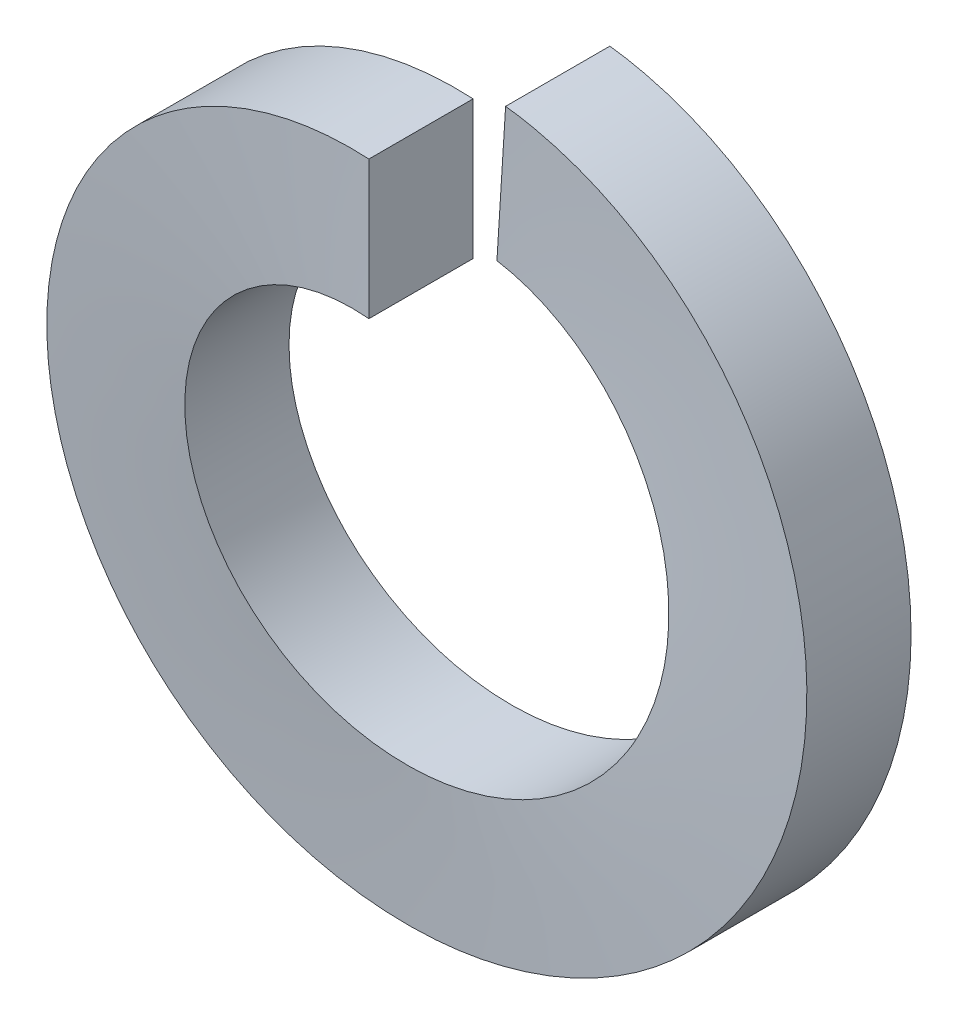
ISO-10303-21;
HEADER;
FILE_DESCRIPTION(('STEP AP214'),'2;1');
FILE_NAME('part.step','',(''),(''),'','','');
FILE_SCHEMA(('AUTOMOTIVE_DESIGN { 1 0 10303 214 1 1 1 1 }'));
ENDSEC;
DATA;
#1=APPLICATION_CONTEXT('core data for automotive mechanical design processes');
#2=APPLICATION_PROTOCOL_DEFINITION('international standard','automotive_design',2000,#1);
#3=PRODUCT_CONTEXT('',#1,'mechanical');
#4=PRODUCT('Part','Part','',(#3));
#5=PRODUCT_RELATED_PRODUCT_CATEGORY('part','',(#4));
#6=PRODUCT_DEFINITION_FORMATION('','',#4);
#7=PRODUCT_DEFINITION_CONTEXT('part definition',#1,'design');
#8=PRODUCT_DEFINITION('design','',#6,#7);
#9=PRODUCT_DEFINITION_SHAPE('','',#8);
#10=(LENGTH_UNIT() NAMED_UNIT(*) SI_UNIT(.MILLI.,.METRE.));
#11=(NAMED_UNIT(*) PLANE_ANGLE_UNIT() SI_UNIT($,.RADIAN.));
#12=(NAMED_UNIT(*) SI_UNIT($,.STERADIAN.) SOLID_ANGLE_UNIT());
#13=UNCERTAINTY_MEASURE_WITH_UNIT(LENGTH_MEASURE(1.E-05),#10,'distance_accuracy_value','');
#14=(GEOMETRIC_REPRESENTATION_CONTEXT(3) GLOBAL_UNCERTAINTY_ASSIGNED_CONTEXT((#13)) GLOBAL_UNIT_ASSIGNED_CONTEXT((#10,
#11,#12)) REPRESENTATION_CONTEXT('',''));
#15=CARTESIAN_POINT('',(0.,0.,0.));
#16=DIRECTION('',(0.,0.,1.));
#17=DIRECTION('',(1.,0.,0.));
#18=AXIS2_PLACEMENT_3D('',#15,#16,#17);
#19=CARTESIAN_POINT('',(0.,12.89685,4.7752));
#20=DIRECTION('',(1.,0.,0.));
#21=DIRECTION('',(0.,0.,-1.));
#22=AXIS2_PLACEMENT_3D('',#19,#20,#21);
#23=PLANE('',#22);
#24=CARTESIAN_POINT('',(0.,16.0655,4.7752));
#25=CARTESIAN_POINT('',(0.,9.7282,4.7752));
#26=(BOUNDED_CURVE() B_SPLINE_CURVE(1,(#24,#25),.UNSPECIFIED.,.F.,
.F.) B_SPLINE_CURVE_WITH_KNOTS((2,2),(0.,1.),
.UNSPECIFIED.) CURVE() GEOMETRIC_REPRESENTATION_ITEM() RATIONAL_B_SPLINE_CURVE((1.,1.)) REPRESENTATION_ITEM(''));
#27=CARTESIAN_POINT('',(0.,16.0655,4.7752));
#28=VERTEX_POINT('',#27);
#29=CARTESIAN_POINT('',(0.,9.7282,4.7752));
#30=VERTEX_POINT('',#29);
#31=EDGE_CURVE('E57',#28,#30,#26,.T.);
#32=ORIENTED_EDGE('',*,*,#31,.T.);
#33=CARTESIAN_POINT('',(0.,9.7282,4.7752));
#34=CARTESIAN_POINT('',(0.,9.7282,0.));
#35=(BOUNDED_CURVE() B_SPLINE_CURVE(1,(#33,#34),.UNSPECIFIED.,.F.,
.F.) B_SPLINE_CURVE_WITH_KNOTS((2,2),(0.,1.),
.UNSPECIFIED.) CURVE() GEOMETRIC_REPRESENTATION_ITEM() RATIONAL_B_SPLINE_CURVE((1.,1.)) REPRESENTATION_ITEM(''));
#36=CARTESIAN_POINT('',(0.,9.7282,0.));
#37=VERTEX_POINT('',#36);
#38=EDGE_CURVE('E89',#30,#37,#35,.T.);
#39=ORIENTED_EDGE('',*,*,#38,.T.);
#40=CARTESIAN_POINT('',(0.,9.7282,0.));
#41=CARTESIAN_POINT('',(0.,16.0655,0.));
#42=(BOUNDED_CURVE() B_SPLINE_CURVE(1,(#40,#41),.UNSPECIFIED.,.F.,
.F.) B_SPLINE_CURVE_WITH_KNOTS((2,2),(0.,1.),
.UNSPECIFIED.) CURVE() GEOMETRIC_REPRESENTATION_ITEM() RATIONAL_B_SPLINE_CURVE((1.,1.)) REPRESENTATION_ITEM(''));
#43=CARTESIAN_POINT('',(0.,16.0655,0.));
#44=VERTEX_POINT('',#43);
#45=EDGE_CURVE('E92',#37,#44,#42,.T.);
#46=ORIENTED_EDGE('',*,*,#45,.T.);
#47=CARTESIAN_POINT('',(0.,16.0655,0.));
#48=CARTESIAN_POINT('',(0.,16.0655,4.7752));
#49=(BOUNDED_CURVE() B_SPLINE_CURVE(1,(#47,#48),.UNSPECIFIED.,.F.,
.F.) B_SPLINE_CURVE_WITH_KNOTS((2,2),(0.,1.),
.UNSPECIFIED.) CURVE() GEOMETRIC_REPRESENTATION_ITEM() RATIONAL_B_SPLINE_CURVE((1.,1.)) REPRESENTATION_ITEM(''));
#50=EDGE_CURVE('E72',#44,#28,#49,.T.);
#51=ORIENTED_EDGE('',*,*,#50,.T.);
#52=EDGE_LOOP('',(#32,#39,#46,#51));
#53=FACE_BOUND('',#52,.T.);
#54=ADVANCED_FACE('F46',(#53),#23,.T.);
#55=CARTESIAN_POINT('',(0.710349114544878,11.2902004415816,-0.478333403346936));
#56=DIRECTION('',(0.998026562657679,-0.0627931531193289,1.228948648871E-05));
#57=DIRECTION('',(0.0627931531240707,0.998026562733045,0.));
#58=AXIS2_PLACEMENT_3D('',#55,#56,#57);
#59=PLANE('',#58);
#60=CARTESIAN_POINT('',(1.00880340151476,16.0337957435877,-0.478333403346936));
#61=CARTESIAN_POINT('',(0.610864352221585,9.70900200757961,-0.478333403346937));
#62=(BOUNDED_CURVE() B_SPLINE_CURVE(1,(#60,#61),.UNSPECIFIED.,.F.,
.F.) B_SPLINE_CURVE_WITH_KNOTS((2,2),(0.,1.),
.UNSPECIFIED.) CURVE() GEOMETRIC_REPRESENTATION_ITEM() RATIONAL_B_SPLINE_CURVE((0.992755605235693,0.992755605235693)) REPRESENTATION_ITEM(''));
#63=CARTESIAN_POINT('',(0.610886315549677,9.70900062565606,-0.478331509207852));
#64=VERTEX_POINT('',#63);
#65=CARTESIAN_POINT('',(1.0088034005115,16.0337957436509,-0.478333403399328));
#66=VERTEX_POINT('',#65);
#67=EDGE_CURVE('E12',#64,#66,#62,.F.);
#68=ORIENTED_EDGE('',*,*,#67,.T.);
#69=CARTESIAN_POINT('',(1.0088034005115,16.0337957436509,-5.25353340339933));
#70=CARTESIAN_POINT('',(1.0088034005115,16.0337957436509,-0.478333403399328));
#71=(BOUNDED_CURVE() B_SPLINE_CURVE(1,(#69,#70),.UNSPECIFIED.,.F.,
.F.) B_SPLINE_CURVE_WITH_KNOTS((2,2),(0.,1.),
.UNSPECIFIED.) CURVE() GEOMETRIC_REPRESENTATION_ITEM() RATIONAL_B_SPLINE_CURVE((0.992755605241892,0.992755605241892)) REPRESENTATION_ITEM(''));
#72=CARTESIAN_POINT('',(1.0088396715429,16.0337934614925,-5.25353150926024));
#73=VERTEX_POINT('',#72);
#74=EDGE_CURVE('E134',#66,#73,#71,.F.);
#75=ORIENTED_EDGE('',*,*,#74,.T.);
#76=CARTESIAN_POINT('',(0.610908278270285,9.70899924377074,-5.25352961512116));
#77=CARTESIAN_POINT('',(1.0088759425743,16.0337911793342,-5.25352961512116));
#78=(BOUNDED_CURVE() B_SPLINE_CURVE(1,(#76,#77),.UNSPECIFIED.,.F.,
.F.) B_SPLINE_CURVE_WITH_KNOTS((2,2),(0.,1.),
.UNSPECIFIED.) CURVE() GEOMETRIC_REPRESENTATION_ITEM() RATIONAL_B_SPLINE_CURVE((0.992755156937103,0.992755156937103)) REPRESENTATION_ITEM(''));
#79=CARTESIAN_POINT('',(0.610908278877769,9.70899924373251,-5.25352961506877));
#80=VERTEX_POINT('',#79);
#81=EDGE_CURVE('E112',#73,#80,#78,.F.);
#82=ORIENTED_EDGE('',*,*,#81,.T.);
#83=CARTESIAN_POINT('',(0.610908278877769,9.70899924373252,-0.478329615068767));
#84=CARTESIAN_POINT('',(0.610908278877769,9.70899924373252,-5.25352961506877));
#85=(BOUNDED_CURVE() B_SPLINE_CURVE(1,(#83,#84),.UNSPECIFIED.,.F.,
.F.) B_SPLINE_CURVE_WITH_KNOTS((2,2),(0.,1.),
.UNSPECIFIED.) CURVE() GEOMETRIC_REPRESENTATION_ITEM() RATIONAL_B_SPLINE_CURVE((0.992755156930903,0.992755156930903)) REPRESENTATION_ITEM(''));
#86=EDGE_CURVE('E97',#80,#64,#85,.F.);
#87=ORIENTED_EDGE('',*,*,#86,.T.);
#88=EDGE_LOOP('',(#68,#75,#82,#87));
#89=FACE_BOUND('',#88,.T.);
#90=ADVANCED_FACE('F48',(#89),#59,.F.);
#91=CARTESIAN_POINT('',(0.,16.0655,4.7752));
#92=CARTESIAN_POINT('',(-4.3047377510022,16.0655,4.55412592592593));
#93=CARTESIAN_POINT('',(-8.03275,13.9131311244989,4.33305185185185));
#94=CARTESIAN_POINT('',(-11.7607622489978,11.7607622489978,4.11197777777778));
#95=CARTESIAN_POINT('',(-13.9131311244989,8.03275,3.8909037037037));
#96=CARTESIAN_POINT('',(-16.0655,4.30473775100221,3.66982962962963));
#97=CARTESIAN_POINT('',(-16.0655,0.,3.44875555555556));
#98=CARTESIAN_POINT('',(-16.0655,-4.3047377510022,3.22768148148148));
#99=CARTESIAN_POINT('',(-13.9131311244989,-8.03275,3.00660740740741));
#100=CARTESIAN_POINT('',(-11.7607622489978,-11.7607622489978,2.78553333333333));
#101=CARTESIAN_POINT('',(-8.03275000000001,-13.9131311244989,2.56445925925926));
#102=CARTESIAN_POINT('',(-4.30473775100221,-16.0655,2.34338518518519));
#103=CARTESIAN_POINT('',(0.,-16.0655,2.12231111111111));
#104=CARTESIAN_POINT('',(4.30473775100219,-16.0655,1.90123703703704));
#105=CARTESIAN_POINT('',(8.03274999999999,-13.9131311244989,1.68016296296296));
#106=CARTESIAN_POINT('',(11.7607622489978,-11.7607622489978,1.45908888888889));
#107=CARTESIAN_POINT('',(13.9131311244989,-8.03275000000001,1.23801481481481));
#108=CARTESIAN_POINT('',(16.0655,-4.30473775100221,1.01694074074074));
#109=CARTESIAN_POINT('',(16.0655,0.,0.795866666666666));
#110=CARTESIAN_POINT('',(16.0655,4.30473775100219,0.574792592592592));
#111=CARTESIAN_POINT('',(13.9131311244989,8.03274999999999,0.353718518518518));
#112=CARTESIAN_POINT('',(11.7607622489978,11.7607622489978,0.132644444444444));
#113=CARTESIAN_POINT('',(8.03275000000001,13.9131311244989,-0.0884296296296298));
#114=CARTESIAN_POINT('',(4.76947392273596,15.7971844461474,-0.281944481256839));
#115=CARTESIAN_POINT('',(1.00880340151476,16.0337957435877,-0.478333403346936));
#116=CARTESIAN_POINT('',(0.,9.7282,4.7752));
#117=CARTESIAN_POINT('',(-2.60666333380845,9.7282,4.55412592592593));
#118=CARTESIAN_POINT('',(-4.8641,8.42486833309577,4.33305185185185));
#119=CARTESIAN_POINT('',(-7.12153666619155,7.12153666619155,4.11197777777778));
#120=CARTESIAN_POINT('',(-8.42486833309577,4.8641,3.8909037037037));
#121=CARTESIAN_POINT('',(-9.7282,2.60666333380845,3.66982962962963));
#122=CARTESIAN_POINT('',(-9.7282,0.,3.44875555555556));
#123=CARTESIAN_POINT('',(-9.7282,-2.60666333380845,3.22768148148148));
#124=CARTESIAN_POINT('',(-8.42486833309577,-4.8641,3.00660740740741));
#125=CARTESIAN_POINT('',(-7.12153666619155,-7.12153666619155,2.78553333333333));
#126=CARTESIAN_POINT('',(-4.8641,-8.42486833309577,2.56445925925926));
#127=CARTESIAN_POINT('',(-2.60666333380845,-9.7282,2.34338518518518));
#128=CARTESIAN_POINT('',(0.,-9.7282,2.12231111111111));
#129=CARTESIAN_POINT('',(2.60666333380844,-9.7282,1.90123703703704));
#130=CARTESIAN_POINT('',(4.8641,-8.42486833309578,1.68016296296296));
#131=CARTESIAN_POINT('',(7.12153666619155,-7.12153666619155,1.45908888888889));
#132=CARTESIAN_POINT('',(8.42486833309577,-4.8641,1.23801481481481));
#133=CARTESIAN_POINT('',(9.7282,-2.60666333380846,1.01694074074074));
#134=CARTESIAN_POINT('',(9.7282,0.,0.795866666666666));
#135=CARTESIAN_POINT('',(9.7282,2.60666333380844,0.574792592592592));
#136=CARTESIAN_POINT('',(8.42486833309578,4.86409999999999,0.353718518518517));
#137=CARTESIAN_POINT('',(7.12153666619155,7.12153666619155,0.132644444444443));
#138=CARTESIAN_POINT('',(4.8641,8.42486833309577,-0.0884296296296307));
#139=CARTESIAN_POINT('',(2.88807669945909,9.56572591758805,-0.28194448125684));
#140=CARTESIAN_POINT('',(0.610864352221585,9.70900200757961,-0.478333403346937));
#141=(BOUNDED_SURFACE() B_SPLINE_SURFACE(1,2,((#91,#92,#93,#94,#95,#96,#97,#98,#99,#100,#101,
#102,#103,#104,#105,#106,#107,#108,#109,#110,#111,#112,#113,#114,#115),(#116,#117,#118,#119,
#120,#121,#122,#123,#124,#125,#126,#127,#128,#129,#130,#131,#132,#133,#134,#135,#136,#137,#138,
#139,#140)),.UNSPECIFIED.,.F.,.F.,.F.) B_SPLINE_SURFACE_WITH_KNOTS((2,2),(3,2,2,2,2,2,2,2,2,2,2,
2,3),(0.,1.),(0.,0.0833333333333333,0.166666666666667,0.25,0.333333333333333,0.416666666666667,
0.5,0.583333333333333,0.666666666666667,0.75,0.833333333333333,0.916666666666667,
0.989922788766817),
.UNSPECIFIED.) GEOMETRIC_REPRESENTATION_ITEM() RATIONAL_B_SPLINE_SURFACE(((1.,0.965925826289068,
1.,0.965925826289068,1.,0.965925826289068,1.,0.965925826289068,1.,0.965925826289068,1.,
0.965925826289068,1.,0.965925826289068,1.,0.965925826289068,1.,0.965925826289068,1.,
0.965925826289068,1.,0.965925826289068,1.,0.970046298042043,0.992755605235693),(1.,
0.965925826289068,1.,0.965925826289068,1.,0.965925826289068,1.,0.965925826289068,1.,
0.965925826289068,1.,0.965925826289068,1.,0.965925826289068,1.,0.965925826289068,1.,
0.965925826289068,1.,0.965925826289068,1.,0.965925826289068,1.,0.970046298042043,0.992755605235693))) REPRESENTATION_ITEM('') SURFACE());
#142=CARTESIAN_POINT('',(0.,16.0655,4.7752));
#143=CARTESIAN_POINT('',(-4.3047377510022,16.0655,4.55412592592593));
#144=CARTESIAN_POINT('',(-8.03275,13.9131311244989,4.33305185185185));
#145=CARTESIAN_POINT('',(-11.7607622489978,11.7607622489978,4.11197777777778));
#146=CARTESIAN_POINT('',(-13.9131311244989,8.03275,3.8909037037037));
#147=CARTESIAN_POINT('',(-16.0655,4.30473775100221,3.66982962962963));
#148=CARTESIAN_POINT('',(-16.0655,0.,3.44875555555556));
#149=CARTESIAN_POINT('',(-16.0655,-4.3047377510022,3.22768148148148));
#150=CARTESIAN_POINT('',(-13.9131311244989,-8.03275,3.00660740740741));
#151=CARTESIAN_POINT('',(-11.7607622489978,-11.7607622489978,2.78553333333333));
#152=CARTESIAN_POINT('',(-8.03275000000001,-13.9131311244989,2.56445925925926));
#153=CARTESIAN_POINT('',(-4.30473775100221,-16.0655,2.34338518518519));
#154=CARTESIAN_POINT('',(0.,-16.0655,2.12231111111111));
#155=CARTESIAN_POINT('',(4.30473775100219,-16.0655,1.90123703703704));
#156=CARTESIAN_POINT('',(8.03274999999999,-13.9131311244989,1.68016296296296));
#157=CARTESIAN_POINT('',(11.7607622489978,-11.7607622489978,1.45908888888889));
#158=CARTESIAN_POINT('',(13.9131311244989,-8.03275000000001,1.23801481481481));
#159=CARTESIAN_POINT('',(16.0655,-4.30473775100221,1.01694074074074));
#160=CARTESIAN_POINT('',(16.0655,0.,0.795866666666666));
#161=CARTESIAN_POINT('',(16.0655,4.30473775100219,0.574792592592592));
#162=CARTESIAN_POINT('',(13.9131311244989,8.03274999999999,0.353718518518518));
#163=CARTESIAN_POINT('',(11.7607622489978,11.7607622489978,0.132644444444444));
#164=CARTESIAN_POINT('',(8.03275000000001,13.9131311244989,-0.0884296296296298));
#165=CARTESIAN_POINT('',(4.76947392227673,15.7971844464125,-0.281944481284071));
#166=CARTESIAN_POINT('',(1.0088034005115,16.0337957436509,-0.478333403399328));
#167=(BOUNDED_CURVE() B_SPLINE_CURVE(2,(#142,#143,#144,#145,#146,#147,#148,#149,#150,#151,#152,
#153,#154,#155,#156,#157,#158,#159,#160,#161,#162,#163,#164,#165,#166),.UNSPECIFIED.,.F.,
.F.) B_SPLINE_CURVE_WITH_KNOTS((3,2,2,2,2,2,2,2,2,2,2,2,3),(0.,0.0833333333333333,
0.166666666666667,0.25,0.333333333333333,0.416666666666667,0.5,0.583333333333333,
0.666666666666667,0.75,0.833333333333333,0.916666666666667,0.989922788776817),
.UNSPECIFIED.) CURVE() GEOMETRIC_REPRESENTATION_ITEM() RATIONAL_B_SPLINE_CURVE((1.,
0.965925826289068,1.,0.965925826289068,1.,0.965925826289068,1.,0.965925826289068,1.,
0.965925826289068,1.,0.965925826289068,1.,0.965925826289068,1.,0.965925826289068,1.,
0.965925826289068,1.,0.965925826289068,1.,0.965925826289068,1.,0.970046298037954,0.992755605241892)) REPRESENTATION_ITEM(''));
#168=EDGE_CURVE('E64',#28,#66,#167,.T.);
#169=CARTESIAN_POINT('',(0.,9.7282,4.7752));
#170=CARTESIAN_POINT('',(-0.192431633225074,9.72820704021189,4.75887982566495));
#171=CARTESIAN_POINT('',(-0.384851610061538,9.7224906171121,4.74243055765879));
#172=CARTESIAN_POINT('',(-0.770179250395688,9.69959489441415,4.70923016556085));
#173=CARTESIAN_POINT('',(-0.963082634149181,9.68234530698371,4.69247780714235));
#174=CARTESIAN_POINT('',(-1.34834026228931,9.63626815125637,4.65875658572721));
#175=CARTESIAN_POINT('',(-1.54068846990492,9.60739055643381,4.64178709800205));
#176=CARTESIAN_POINT('',(-1.92378532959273,9.53807685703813,4.60772098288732));
#177=CARTESIAN_POINT('',(-2.1145287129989,9.49761173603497,4.59062414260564));
#178=CARTESIAN_POINT('',(-2.49336973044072,9.40526563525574,4.55639592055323));
#179=CARTESIAN_POINT('',(-2.68146544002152,9.35337676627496,4.53926452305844));
#180=CARTESIAN_POINT('',(-3.05398808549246,9.23845138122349,4.5050576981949));
#181=CARTESIAN_POINT('',(-3.2384189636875,9.17542765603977,4.4879822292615));
#182=CARTESIAN_POINT('',(-3.6026314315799,9.0386199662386,4.45398797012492));
#183=CARTESIAN_POINT('',(-3.78242518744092,8.96486846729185,4.43706886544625));
#184=CARTESIAN_POINT('',(-4.1364389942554,8.8071064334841,4.40344462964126));
#185=CARTESIAN_POINT('',(-4.31068154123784,8.72314651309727,4.3867388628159));
#186=CARTESIAN_POINT('',(-4.6528342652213,8.54552126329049,4.35373864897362));
#187=CARTESIAN_POINT('',(-4.8207764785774,8.4519179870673,4.33744231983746));
#188=CARTESIAN_POINT('',(-5.15130004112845,8.25464333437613,4.30463079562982));
#189=CARTESIAN_POINT('',(-5.31386398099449,8.15094287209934,4.28811509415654));
#190=CARTESIAN_POINT('',(-5.633441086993,7.93345994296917,4.25478264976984));
#191=CARTESIAN_POINT('',(-5.79041724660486,7.81962327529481,4.23796472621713));
#192=CARTESIAN_POINT('',(-6.09788020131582,7.5823209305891,4.20413930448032));
#193=CARTESIAN_POINT('',(-6.2483392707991,7.45881939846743,4.18713132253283));
#194=CARTESIAN_POINT('',(-6.54188120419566,7.20275491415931,4.15300921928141));
#195=CARTESIAN_POINT('',(-6.68494809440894,7.07017366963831,4.13589495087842));
#196=CARTESIAN_POINT('',(-6.96289026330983,6.79662153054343,4.1016547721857));
#197=CARTESIAN_POINT('',(-7.09776354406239,6.65564860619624,4.08452886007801));
#198=CARTESIAN_POINT('',(-7.35858895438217,6.36607837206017,4.05035645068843));
#199=CARTESIAN_POINT('',(-7.48455492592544,6.2174935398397,4.03330987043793));
#200=CARTESIAN_POINT('',(-7.72693544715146,5.91354359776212,3.99939247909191));
#201=CARTESIAN_POINT('',(-7.84338110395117,5.75820333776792,3.98252126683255));
#202=CARTESIAN_POINT('',(-8.06619929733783,5.44165172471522,3.9490260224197));
#203=CARTESIAN_POINT('',(-8.17262113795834,5.28047516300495,3.93240116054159));
#204=CARTESIAN_POINT('',(-8.3751801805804,4.95289053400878,3.89951589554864));
#205=CARTESIAN_POINT('',(-8.47136697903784,4.78651327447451,3.88325406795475));
#206=CARTESIAN_POINT('',(-8.65416702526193,4.44753172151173,3.85037604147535));
#207=CARTESIAN_POINT('',(-8.74073004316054,4.27490047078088,3.83375847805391));
#208=CARTESIAN_POINT('',(-8.90385645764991,3.92388414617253,3.80027443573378));
#209=CARTESIAN_POINT('',(-8.98036474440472,3.74547354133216,3.78340710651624));
#210=CARTESIAN_POINT('',(-9.12281787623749,3.38378170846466,3.74949619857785));
#211=CARTESIAN_POINT('',(-9.18872528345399,3.20048577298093,3.73245221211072));
#212=CARTESIAN_POINT('',(-9.3095198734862,2.82997251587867,3.69828304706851));
#213=CARTESIAN_POINT('',(-9.36438893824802,2.64274929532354,3.6811577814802));
#214=CARTESIAN_POINT('',(-9.4627655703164,2.26538212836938,3.64691717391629));
#215=CARTESIAN_POINT('',(-9.50627548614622,2.07523879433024,3.62980183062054));
#216=CARTESIAN_POINT('',(-9.58171516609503,1.69306506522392,3.59567553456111));
#217=CARTESIAN_POINT('',(-9.61366834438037,1.50103930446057,3.57866444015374));
#218=CARTESIAN_POINT('',(-9.66590177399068,1.11614956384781,3.54483190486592));
#219=CARTESIAN_POINT('',(-9.68622653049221,0.923291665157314,3.52800998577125));
#220=CARTESIAN_POINT('',(-9.7152366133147,0.537779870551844,3.49466467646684));
#221=CARTESIAN_POINT('',(-9.72398698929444,0.345130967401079,3.47814013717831));
#222=CARTESIAN_POINT('',(-9.73001634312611,-0.0397530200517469,3.44532494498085));
#223=CARTESIAN_POINT('',(-9.72733145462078,-0.231987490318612,3.4290337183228));
#224=CARTESIAN_POINT('',(-9.71053248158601,-0.617099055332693,3.39604432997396));
#225=CARTESIAN_POINT('',(-9.69634915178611,-0.809972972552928,3.37934429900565));
#226=CARTESIAN_POINT('',(-9.65642272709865,-1.1954502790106,3.34572959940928));
#227=CARTESIAN_POINT('',(-9.63062414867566,-1.38804786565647,3.32881428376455));
#228=CARTESIAN_POINT('',(-9.56745117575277,-1.77192130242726,3.29482581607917));
#229=CARTESIAN_POINT('',(-9.53004216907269,-1.96319142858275,3.27775234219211));
#230=CARTESIAN_POINT('',(-9.44375826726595,-2.34336148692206,3.24354801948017));
#231=CARTESIAN_POINT('',(-9.39486991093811,-2.53225836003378,3.2264171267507));
#232=CARTESIAN_POINT('',(-9.28586264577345,-2.90665073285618,3.19218683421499));
#233=CARTESIAN_POINT('',(-9.22575113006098,-3.09214838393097,3.17508742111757));
#234=CARTESIAN_POINT('',(-9.09465405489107,-3.45874888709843,3.14101909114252));
#235=CARTESIAN_POINT('',(-9.02369588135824,-3.63986151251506,3.12404995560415));
#236=CARTESIAN_POINT('',(-8.87137749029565,-3.99675100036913,3.09031014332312));
#237=CARTESIAN_POINT('',(-8.79006325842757,-4.17254743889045,3.0735389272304));
#238=CARTESIAN_POINT('',(-8.61760462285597,-4.5179416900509,3.04036423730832));
#239=CARTESIAN_POINT('',(-8.52652297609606,-4.68757068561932,3.02395914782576));
#240=CARTESIAN_POINT('',(-8.33448355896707,-5.02108316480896,2.99116952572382));
#241=CARTESIAN_POINT('',(-8.23352847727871,-5.1849681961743,2.9747849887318));
#242=CARTESIAN_POINT('',(-8.0214380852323,-5.50743866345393,2.94163922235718));
#243=CARTESIAN_POINT('',(-7.91024369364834,-5.66598506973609,2.92487629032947));
#244=CARTESIAN_POINT('',(-7.67809384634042,-5.97683393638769,2.89115204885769));
#245=CARTESIAN_POINT('',(-7.557097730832,-6.12910597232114,2.87419019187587));
#246=CARTESIAN_POINT('',(-7.30588351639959,-6.42650192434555,2.84013219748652));
#247=CARTESIAN_POINT('',(-7.17564258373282,-6.57160652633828,2.82303582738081));
#248=CARTESIAN_POINT('',(-6.90658358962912,-6.85383227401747,2.78880817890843));
#249=CARTESIAN_POINT('',(-6.76775934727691,-6.99094752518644,2.77167688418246));
#250=CARTESIAN_POINT('',(-6.48227570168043,-7.25644073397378,2.73746805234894));
#251=CARTESIAN_POINT('',(-6.33562513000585,-7.38482818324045,2.72039047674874));
#252=CARTESIAN_POINT('',(-6.0353131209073,-7.63220841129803,2.68639036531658));
#253=CARTESIAN_POINT('',(-5.88167348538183,-7.75122761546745,2.66946752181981));
#254=CARTESIAN_POINT('',(-5.56827845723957,-7.97931917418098,2.63583391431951));
#255=CARTESIAN_POINT('',(-5.40855546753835,-8.0884359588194,2.61912252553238));
#256=CARTESIAN_POINT('',(-5.08386346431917,-8.29633280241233,2.58611119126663));
#257=CARTESIAN_POINT('',(-4.91893248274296,-8.39517196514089,2.56980935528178));
#258=CARTESIAN_POINT('',(-4.58305281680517,-8.58316059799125,2.53700121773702));
#259=CARTESIAN_POINT('',(-4.41208873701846,-8.6722824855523,2.5204944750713));
#260=CARTESIAN_POINT('',(-4.06418883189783,-8.84069044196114,2.48717502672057));
#261=CARTESIAN_POINT('',(-3.88722433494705,-8.91991704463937,2.4703611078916));
#262=CARTESIAN_POINT('',(-3.52818336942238,-9.06794636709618,2.43654284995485));
#263=CARTESIAN_POINT('',(-3.34608950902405,-9.13670679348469,2.41953802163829));
#264=CARTESIAN_POINT('',(-2.97772362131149,-9.26331735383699,2.38542018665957));
#265=CARTESIAN_POINT('',(-2.7914435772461,-9.32114412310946,2.36830702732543));
#266=CARTESIAN_POINT('',(-2.41569385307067,-9.42551479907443,2.33406734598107));
#267=CARTESIAN_POINT('',(-2.22622329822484,-9.47205555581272,2.3169408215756));
#268=CARTESIAN_POINT('',(-1.84511951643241,-9.55360261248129,2.28276524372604));
#269=CARTESIAN_POINT('',(-1.65349010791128,-9.58862672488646,2.26571611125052));
#270=CARTESIAN_POINT('',(-1.2691145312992,-9.64701424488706,2.23179228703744));
#271=CARTESIAN_POINT('',(-1.0763743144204,-9.67041660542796,2.21491720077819));
#272=CARTESIAN_POINT('',(-0.690825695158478,-9.70556094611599,2.18141088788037));
#273=CARTESIAN_POINT('',(-0.498022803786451,-9.71736262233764,2.16477885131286));
#274=CARTESIAN_POINT('',(-0.113036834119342,-9.72943938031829,2.13188606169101));
#275=CARTESIAN_POINT('',(0.079144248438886,-9.7297741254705,2.11562382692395));
#276=CARTESIAN_POINT('',(0.464101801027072,-9.71904037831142,2.08275275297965));
#277=CARTESIAN_POINT('',(0.656876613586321,-9.70791635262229,2.06614261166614));
#278=CARTESIAN_POINT('',(1.04242951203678,-9.67413360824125,2.03266990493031));
#279=CARTESIAN_POINT('',(1.23520218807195,-9.65141400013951,2.01580646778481));
#280=CARTESIAN_POINT('',(1.619704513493,-9.59439097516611,1.98190209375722));
#281=CARTESIAN_POINT('',(1.81142816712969,-9.5600473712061,1.96486074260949));
#282=CARTESIAN_POINT('',(2.19278186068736,-9.47985292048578,1.93069489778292));
#283=CARTESIAN_POINT('',(2.38240788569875,-9.43398301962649,1.91357031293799));
#284=CARTESIAN_POINT('',(2.75852865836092,-9.33093830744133,1.87932934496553));
#285=CARTESIAN_POINT('',(2.94502393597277,-9.27376543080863,1.86221296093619));
#286=CARTESIAN_POINT('',(3.3138778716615,-9.14843990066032,1.82808254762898));
#287=CARTESIAN_POINT('',(3.49624406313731,-9.08030945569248,1.8110683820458));
#288=CARTESIAN_POINT('',(3.85588404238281,-8.93351062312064,1.77722878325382));
#289=CARTESIAN_POINT('',(4.03317461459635,-8.85488346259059,1.76040287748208));
#290=CARTESIAN_POINT('',(4.3817757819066,-8.68763950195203,1.72704483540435));
#291=CARTESIAN_POINT('',(4.55311434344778,-8.59908121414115,1.71051158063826));
#292=CARTESIAN_POINT('',(4.88967604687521,-8.41224474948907,1.67769243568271));
#293=CARTESIAN_POINT('',(5.05491773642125,-8.31400009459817,1.66140590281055));
#294=CARTESIAN_POINT('',(5.38024745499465,-8.10729186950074,1.62842705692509));
#295=CARTESIAN_POINT('',(5.54029849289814,-7.9987703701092,1.61173289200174));
#296=CARTESIAN_POINT('',(5.85440480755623,-7.77184276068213,1.57812784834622));
#297=CARTESIAN_POINT('',(6.00842713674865,-7.65339114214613,1.56121631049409));
#298=CARTESIAN_POINT('',(6.30955661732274,-7.40711275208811,1.52723374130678));
#299=CARTESIAN_POINT('',(6.45664127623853,-7.2792585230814,1.51016238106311));
#300=CARTESIAN_POINT('',(6.74304099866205,-7.01479229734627,1.47596042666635));
#301=CARTESIAN_POINT('',(6.88234640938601,-6.87816985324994,1.45882978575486));
#302=CARTESIAN_POINT('',(7.15241060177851,-6.59688475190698,1.42459827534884));
#303=CARTESIAN_POINT('',(7.28317463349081,-6.45222713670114,1.40749739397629));
#304=CARTESIAN_POINT('',(7.53547203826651,-6.15567562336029,1.37342400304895));
#305=CARTESIAN_POINT('',(7.65702723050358,-6.00380031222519,1.35645128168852));
#306=CARTESIAN_POINT('',(7.89032597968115,-5.69369129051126,1.32270378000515));
#307=CARTESIAN_POINT('',(8.00210912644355,-5.53548742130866,1.30592846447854));
#308=CARTESIAN_POINT('',(8.21539996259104,-5.21364748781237,1.27273940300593));
#309=CARTESIAN_POINT('',(8.31696567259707,-5.05005003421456,1.25632408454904));
#310=CARTESIAN_POINT('',(8.51016216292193,-4.71720494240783,1.223534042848));
#311=CARTESIAN_POINT('',(8.60179824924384,-4.54796038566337,1.20715930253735));
#312=CARTESIAN_POINT('',(8.77540246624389,-4.20329082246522,1.17402767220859));
#313=CARTESIAN_POINT('',(8.85730704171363,-4.0278339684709,1.15726904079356));
#314=CARTESIAN_POINT('',(9.01083935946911,-3.67157158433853,1.12355276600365));
#315=CARTESIAN_POINT('',(9.08242007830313,-3.49074584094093,1.10659457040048));
#316=CARTESIAN_POINT('',(9.2147890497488,-3.12466339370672,1.07254182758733));
#317=CARTESIAN_POINT('',(9.2755487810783,-2.93939639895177,1.05544704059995));
#318=CARTESIAN_POINT('',(9.38587253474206,-2.56540654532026,1.02122082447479));
#319=CARTESIAN_POINT('',(9.43542796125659,-2.37668115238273,1.0040893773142));
#320=CARTESIAN_POINT('',(9.52305884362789,-1.99679333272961,0.969878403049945));
#321=CARTESIAN_POINT('',(9.56114652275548,-1.80563372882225,0.952798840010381));
#322=CARTESIAN_POINT('',(9.62568228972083,-1.4219197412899,0.918792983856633));
#323=CARTESIAN_POINT('',(9.65216375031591,-1.22937099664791,0.901866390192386));
#324=CARTESIAN_POINT('',(9.69345395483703,-0.84393008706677,0.868223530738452));
#325=CARTESIAN_POINT('',(9.70831697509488,-0.651043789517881,0.851506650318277));
#326=CARTESIAN_POINT('',(9.72646464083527,-0.265889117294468,0.818483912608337));
#327=CARTESIAN_POINT('',(9.72981986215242,-0.0736242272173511,0.802176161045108));
#328=CARTESIAN_POINT('',(9.72512904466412,0.31124629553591,0.769371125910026));
#329=CARTESIAN_POINT('',(9.71705379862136,0.503851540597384,0.752873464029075));
#330=CARTESIAN_POINT('',(9.68940212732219,0.889335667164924,0.719567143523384));
#331=CARTESIAN_POINT('',(9.66975947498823,1.0822096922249,0.702757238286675));
#332=CARTESIAN_POINT('',(9.61889120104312,1.46719350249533,0.668946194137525));
#333=CARTESIAN_POINT('',(9.58761984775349,1.65929720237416,0.651944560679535));
#334=CARTESIAN_POINT('',(9.51353736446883,2.04168838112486,0.617831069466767));
#335=CARTESIAN_POINT('',(9.47070157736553,2.23197106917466,0.600719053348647));
#336=CARTESIAN_POINT('',(9.37365937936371,2.60967752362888,0.566479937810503));
#337=CARTESIAN_POINT('',(9.31944939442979,2.79710037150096,0.549352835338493));
#338=CARTESIAN_POINT('',(9.19995201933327,3.16807123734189,0.515174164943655));
#339=CARTESIAN_POINT('',(9.13468157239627,3.35162470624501,0.498122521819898));
#340=CARTESIAN_POINT('',(8.99347463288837,3.71388688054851,0.464192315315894));
#341=CARTESIAN_POINT('',(8.91757448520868,3.89260971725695,0.447313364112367));
#342=CARTESIAN_POINT('',(8.75563074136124,4.24430118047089,0.413796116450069));
#343=CARTESIAN_POINT('',(8.66964126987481,4.41729465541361,0.397157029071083));
#344=CARTESIAN_POINT('',(8.48798987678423,4.75697346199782,0.364256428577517));
#345=CARTESIAN_POINT('',(8.39238175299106,4.92368741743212,0.347993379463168));
#346=CARTESIAN_POINT('',(8.19099912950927,5.25191970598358,0.315128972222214));
#347=CARTESIAN_POINT('',(8.08517862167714,5.41340968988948,0.298526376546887));
#348=CARTESIAN_POINT('',(7.8635384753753,5.73064365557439,0.26506513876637));
#349=CARTESIAN_POINT('',(7.74766844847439,5.88635233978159,0.248205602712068));
#350=CARTESIAN_POINT('',(7.50640752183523,6.1910922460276,0.214307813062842));
#351=CARTESIAN_POINT('',(7.38098446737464,6.340097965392,0.197269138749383));
#352=CARTESIAN_POINT('',(7.12120701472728,6.6305590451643,0.163106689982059));
#353=CARTESIAN_POINT('',(6.98683779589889,6.77200113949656,0.145982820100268));
#354=CARTESIAN_POINT('',(6.70986016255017,7.04653590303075,0.111741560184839));
#355=CARTESIAN_POINT('',(6.5672528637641,7.17962969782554,0.0946241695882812));
#356=CARTESIAN_POINT('',(6.2745817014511,7.43675788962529,0.0604897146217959));
#357=CARTESIAN_POINT('',(6.12453304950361,7.56080958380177,0.0434725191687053));
#358=CARTESIAN_POINT('',(5.81783830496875,7.7992447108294,0.0096259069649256));
#359=CARTESIAN_POINT('',(5.6612193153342,7.91366294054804,-0.00720397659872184));
#360=CARTESIAN_POINT('',(5.34230180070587,8.13233422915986,-0.0405746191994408));
#361=CARTESIAN_POINT('',(5.18003980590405,8.23664040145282,-0.057116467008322));
#362=CARTESIAN_POINT('',(4.8501722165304,8.43508261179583,-0.0899398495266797));
#363=CARTESIAN_POINT('',(4.68258750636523,8.52925325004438,-0.106222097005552));
#364=CARTESIAN_POINT('',(4.34114413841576,8.70802523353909,-0.139190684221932));
#365=CARTESIAN_POINT('',(4.16725403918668,8.79256619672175,-0.155878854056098));
#366=CARTESIAN_POINT('',(3.81389459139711,8.95152488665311,-0.189474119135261));
#367=CARTESIAN_POINT('',(3.63440208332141,9.02589099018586,-0.206381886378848));
#368=CARTESIAN_POINT('',(3.27073727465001,9.16395650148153,-0.240358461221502));
#369=CARTESIAN_POINT('',(3.08655225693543,9.22762233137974,-0.257427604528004));
#370=CARTESIAN_POINT('',(2.71446324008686,9.34385365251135,-0.2916272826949));
#371=CARTESIAN_POINT('',(2.52655487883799,9.39640516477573,-0.308757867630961));
#372=CARTESIAN_POINT('',(2.14802831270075,9.49009194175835,-0.342989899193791));
#373=CARTESIAN_POINT('',(1.95741175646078,9.53123386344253,-0.360091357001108));
#374=CARTESIAN_POINT('',(1.57450680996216,9.60190629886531,-0.394172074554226));
#375=CARTESIAN_POINT('',(1.38222356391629,9.63146459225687,-0.411151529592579));
#376=CARTESIAN_POINT('',(0.997035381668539,9.67891158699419,-0.444897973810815));
#377=CARTESIAN_POINT('',(0.804136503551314,9.69684905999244,-0.461665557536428));
#378=CARTESIAN_POINT('',(0.610864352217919,9.7090020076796,-0.478333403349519));
#379=B_SPLINE_CURVE_WITH_KNOTS('',3,(#169,#170,#171,#172,#173,#174,#175,#176,#177,#178,#179,
#180,#181,#182,#183,#184,#185,#186,#187,#188,#189,#190,#191,#192,#193,#194,#195,#196,#197,#198,
#199,#200,#201,#202,#203,#204,#205,#206,#207,#208,#209,#210,#211,#212,#213,#214,#215,#216,#217,
#218,#219,#220,#221,#222,#223,#224,#225,#226,#227,#228,#229,#230,#231,#232,#233,#234,#235,#236,
#237,#238,#239,#240,#241,#242,#243,#244,#245,#246,#247,#248,#249,#250,#251,#252,#253,#254,#255,
#256,#257,#258,#259,#260,#261,#262,#263,#264,#265,#266,#267,#268,#269,#270,#271,#272,#273,#274,
#275,#276,#277,#278,#279,#280,#281,#282,#283,#284,#285,#286,#287,#288,#289,#290,#291,#292,#293,
#294,#295,#296,#297,#298,#299,#300,#301,#302,#303,#304,#305,#306,#307,#308,#309,#310,#311,#312,
#313,#314,#315,#316,#317,#318,#319,#320,#321,#322,#323,#324,#325,#326,#327,#328,#329,#330,#331,
#332,#333,#334,#335,#336,#337,#338,#339,#340,#341,#342,#343,#344,#345,#346,#347,#348,#349,#350,
#351,#352,#353,#354,#355,#356,#357,#358,#359,#360,#361,#362,#363,#364,#365,#366,#367,#368,#369,
#370,#371,#372,#373,#374,#375,#376,#377,#378),.UNSPECIFIED.,.F.,.F.,(4,2,2,2,2,2,2,2,2,2,2,2,2,
2,2,2,2,2,2,2,2,2,2,2,2,2,2,2,2,2,2,2,2,2,2,2,2,2,2,2,2,2,2,2,2,2,2,2,2,2,2,2,2,2,2,2,2,2,2,2,2,
2,2,2,2,2,2,2,2,2,2,2,2,2,2,2,2,2,2,2,2,2,2,2,2,2,2,2,2,2,2,2,2,2,2,2,2,2,2,2,2,2,2,2,4),(0.,
0.579282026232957,1.16212701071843,1.74750679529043,2.33436544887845,2.92163066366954,
3.50822560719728,4.09308090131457,4.6751463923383,5.25367614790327,5.83392469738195,
6.41748735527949,7.00332813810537,7.59038602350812,8.17758648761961,8.76385341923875,
9.34812107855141,9.92934576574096,10.50761171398,11.0887666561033,11.6729846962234,
12.2592226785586,12.8464151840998,13.4334861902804,14.019361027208,14.6029782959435,
15.1833014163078,15.7617921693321,16.3437927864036,16.9286034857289,17.5151746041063,
18.1024370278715,18.6893139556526,19.2747328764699,19.8576374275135,20.4369988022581,
21.0162028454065,21.598987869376,22.184328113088,22.7711680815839,23.3584356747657,
23.9450540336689,24.5299535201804,25.1120834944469,25.690655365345,26.2708289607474,
26.8543366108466,27.4401429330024,28.0271872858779,28.6143952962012,29.2006907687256,
29.7850076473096,30.3663016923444,30.9445707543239,31.5256555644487,32.1098235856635,
32.6960322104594,33.2832163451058,33.8703000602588,34.4562085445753,35.0398800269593,
35.6202773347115,36.1987321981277,36.7806675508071,37.3654332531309,37.9519801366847,
38.5392393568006,39.1261341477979,39.7115918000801,40.2945555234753,40.8739958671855,
41.4531250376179,42.0358497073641,42.6211500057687,43.2079708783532,43.7952404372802,
44.3818818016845,44.9668250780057,45.5490191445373,46.1276362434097,46.7077345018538,
47.2911867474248,47.8769582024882,48.463988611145,49.0512037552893,49.6375273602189,
50.2218930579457,50.8032560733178,51.3815313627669,51.9625456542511,52.5466632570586,
53.1328421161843,53.7200174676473,54.307113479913,54.8930552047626,55.4767805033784,
56.0572516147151,56.6356737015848,57.2175433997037,57.8022637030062,58.3887859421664,
58.9760415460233,59.5629537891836,60.1484497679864,60.7314722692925),.UNSPECIFIED.);
#380=EDGE_CURVE('E106',#30,#64,#379,.T.);
#381=ORIENTED_EDGE('',*,*,#31,.F.);
#382=ORIENTED_EDGE('',*,*,#168,.T.);
#383=ORIENTED_EDGE('',*,*,#67,.F.);
#384=ORIENTED_EDGE('',*,*,#380,.F.);
#385=EDGE_LOOP('',(#381,#382,#383,#384));
#386=FACE_BOUND('',#385,.T.);
#387=ADVANCED_FACE('F203',(#386),#141,.F.);
#388=CARTESIAN_POINT('',(0.,16.0655,0.));
#389=CARTESIAN_POINT('',(-4.3047377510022,16.0655,-0.221074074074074));
#390=CARTESIAN_POINT('',(-8.03275,13.9131311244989,-0.442148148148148));
#391=CARTESIAN_POINT('',(-11.7607622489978,11.7607622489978,-0.663222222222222));
#392=CARTESIAN_POINT('',(-13.9131311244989,8.03275,-0.884296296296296));
#393=CARTESIAN_POINT('',(-16.0655,4.30473775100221,-1.10537037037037));
#394=CARTESIAN_POINT('',(-16.0655,0.,-1.32644444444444));
#395=CARTESIAN_POINT('',(-16.0655,-4.3047377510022,-1.54751851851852));
#396=CARTESIAN_POINT('',(-13.9131311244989,-8.03275,-1.76859259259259));
#397=CARTESIAN_POINT('',(-11.7607622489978,-11.7607622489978,-1.98966666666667));
#398=CARTESIAN_POINT('',(-8.03275000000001,-13.9131311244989,-2.21074074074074));
#399=CARTESIAN_POINT('',(-4.30473775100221,-16.0655,-2.43181481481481));
#400=CARTESIAN_POINT('',(0.,-16.0655,-2.65288888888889));
#401=CARTESIAN_POINT('',(4.30473775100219,-16.0655,-2.87396296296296));
#402=CARTESIAN_POINT('',(8.03274999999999,-13.9131311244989,-3.09503703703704));
#403=CARTESIAN_POINT('',(11.7607622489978,-11.7607622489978,-3.31611111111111));
#404=CARTESIAN_POINT('',(13.9131311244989,-8.03275000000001,-3.53718518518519));
#405=CARTESIAN_POINT('',(16.0655,-4.30473775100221,-3.75825925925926));
#406=CARTESIAN_POINT('',(16.0655,0.,-3.97933333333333));
#407=CARTESIAN_POINT('',(16.0655,4.30473775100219,-4.20040740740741));
#408=CARTESIAN_POINT('',(13.9131311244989,8.03274999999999,-4.42148148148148));
#409=CARTESIAN_POINT('',(11.7607622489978,11.7607622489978,-4.64255555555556));
#410=CARTESIAN_POINT('',(8.03275000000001,13.9131311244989,-4.86362962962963));
#411=CARTESIAN_POINT('',(4.76947392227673,15.7971844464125,-5.05714448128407));
#412=CARTESIAN_POINT('',(1.0088034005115,16.0337957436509,-5.25353340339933));
#413=CARTESIAN_POINT('',(0.,16.0655,4.7752));
#414=CARTESIAN_POINT('',(-4.3047377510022,16.0655,4.55412592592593));
#415=CARTESIAN_POINT('',(-8.03275,13.9131311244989,4.33305185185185));
#416=CARTESIAN_POINT('',(-11.7607622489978,11.7607622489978,4.11197777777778));
#417=CARTESIAN_POINT('',(-13.9131311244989,8.03275,3.8909037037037));
#418=CARTESIAN_POINT('',(-16.0655,4.30473775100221,3.66982962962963));
#419=CARTESIAN_POINT('',(-16.0655,0.,3.44875555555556));
#420=CARTESIAN_POINT('',(-16.0655,-4.3047377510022,3.22768148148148));
#421=CARTESIAN_POINT('',(-13.9131311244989,-8.03275,3.00660740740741));
#422=CARTESIAN_POINT('',(-11.7607622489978,-11.7607622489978,2.78553333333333));
#423=CARTESIAN_POINT('',(-8.03275000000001,-13.9131311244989,2.56445925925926));
#424=CARTESIAN_POINT('',(-4.30473775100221,-16.0655,2.34338518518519));
#425=CARTESIAN_POINT('',(0.,-16.0655,2.12231111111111));
#426=CARTESIAN_POINT('',(4.30473775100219,-16.0655,1.90123703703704));
#427=CARTESIAN_POINT('',(8.03274999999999,-13.9131311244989,1.68016296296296));
#428=CARTESIAN_POINT('',(11.7607622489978,-11.7607622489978,1.45908888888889));
#429=CARTESIAN_POINT('',(13.9131311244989,-8.03275000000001,1.23801481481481));
#430=CARTESIAN_POINT('',(16.0655,-4.30473775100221,1.01694074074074));
#431=CARTESIAN_POINT('',(16.0655,0.,0.795866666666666));
#432=CARTESIAN_POINT('',(16.0655,4.30473775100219,0.574792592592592));
#433=CARTESIAN_POINT('',(13.9131311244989,8.03274999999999,0.353718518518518));
#434=CARTESIAN_POINT('',(11.7607622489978,11.7607622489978,0.132644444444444));
#435=CARTESIAN_POINT('',(8.03275000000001,13.9131311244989,-0.0884296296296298));
#436=CARTESIAN_POINT('',(4.76947392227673,15.7971844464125,-0.281944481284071));
#437=CARTESIAN_POINT('',(1.0088034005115,16.0337957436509,-0.478333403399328));
#438=(BOUNDED_SURFACE() B_SPLINE_SURFACE(1,2,((#388,#389,#390,#391,#392,#393,#394,#395,#396,
#397,#398,#399,#400,#401,#402,#403,#404,#405,#406,#407,#408,#409,#410,#411,#412),(#413,#414,
#415,#416,#417,#418,#419,#420,#421,#422,#423,#424,#425,#426,#427,#428,#429,#430,#431,#432,#433,
#434,#435,#436,#437)),.UNSPECIFIED.,.F.,.F.,.F.) B_SPLINE_SURFACE_WITH_KNOTS((2,2),(3,2,2,2,2,2,
2,2,2,2,2,2,3),(0.,1.),(0.,0.0833333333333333,0.166666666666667,0.25,0.333333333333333,
0.416666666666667,0.5,0.583333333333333,0.666666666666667,0.75,0.833333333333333,
0.916666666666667,0.989922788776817),
.UNSPECIFIED.) GEOMETRIC_REPRESENTATION_ITEM() RATIONAL_B_SPLINE_SURFACE(((1.,0.965925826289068,
1.,0.965925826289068,1.,0.965925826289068,1.,0.965925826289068,1.,0.965925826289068,1.,
0.965925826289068,1.,0.965925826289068,1.,0.965925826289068,1.,0.965925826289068,1.,
0.965925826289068,1.,0.965925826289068,1.,0.970046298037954,0.992755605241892),(1.,
0.965925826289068,1.,0.965925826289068,1.,0.965925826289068,1.,0.965925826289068,1.,
0.965925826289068,1.,0.965925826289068,1.,0.965925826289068,1.,0.965925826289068,1.,
0.965925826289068,1.,0.965925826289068,1.,0.965925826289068,1.,0.970046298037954,0.992755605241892))) REPRESENTATION_ITEM('') SURFACE());
#439=CARTESIAN_POINT('',(0.,16.0655,0.));
#440=CARTESIAN_POINT('',(-0.171855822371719,16.0655010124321,-0.00882581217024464));
#441=CARTESIAN_POINT('',(-0.343709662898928,16.0627424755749,-0.0176894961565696));
#442=CARTESIAN_POINT('',(-0.687878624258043,16.0516933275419,-0.0355166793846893));
#443=CARTESIAN_POINT('',(-0.860193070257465,16.0433820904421,-0.0444804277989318));
#444=CARTESIAN_POINT('',(-1.20501593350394,16.0211789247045,-0.0624946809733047));
#445=CARTESIAN_POINT('',(-1.37752319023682,16.0072691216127,-0.0715453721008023));
#446=CARTESIAN_POINT('',(-1.72246018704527,15.9738388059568,-0.0897199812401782));
#447=CARTESIAN_POINT('',(-1.89488846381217,15.9543032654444,-0.0988440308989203));
#448=CARTESIAN_POINT('',(-2.23939313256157,15.9096085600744,-0.117151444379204));
#449=CARTESIAN_POINT('',(-2.41146794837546,15.884437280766,-0.126334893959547));
#450=CARTESIAN_POINT('',(-2.75498988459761,15.8284760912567,-0.144746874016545));
#451=CARTESIAN_POINT('',(-2.92643551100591,15.7976770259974,-0.153975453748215));
#452=CARTESIAN_POINT('',(-3.26842325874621,15.7304831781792,-0.17246321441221));
#453=CARTESIAN_POINT('',(-3.43896416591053,15.6940822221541,-0.181722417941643));
#454=CARTESIAN_POINT('',(-3.77886813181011,15.6157254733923,-0.20025677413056));
#455=CARTESIAN_POINT('',(-3.94823045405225,15.5737664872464,-0.209531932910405));
#456=CARTESIAN_POINT('',(-4.28550583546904,15.4843523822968,-0.228083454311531));
#457=CARTESIAN_POINT('',(-4.45341883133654,15.4368970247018,-0.237359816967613));
#458=CARTESIAN_POINT('',(-4.78752852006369,15.3365664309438,-0.255898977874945));
#459=CARTESIAN_POINT('',(-4.95372601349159,15.2836938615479,-0.2651617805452));
#460=CARTESIAN_POINT('',(-5.28414344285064,15.1726222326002,-0.283659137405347));
#461=CARTESIAN_POINT('',(-5.44836522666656,15.1144286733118,-0.292893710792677));
#462=CARTESIAN_POINT('',(-5.7745771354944,14.9928250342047,-0.311319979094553));
#463=CARTESIAN_POINT('',(-5.93657032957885,14.9294231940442,-0.320511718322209));
#464=CARTESIAN_POINT('',(-6.25807939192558,14.7975288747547,-0.338838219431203));
#465=CARTESIAN_POINT('',(-6.41759971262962,14.7290472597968,-0.347973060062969));
#466=CARTESIAN_POINT('',(-6.73392708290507,14.5871343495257,-0.366170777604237));
#467=CARTESIAN_POINT('',(-6.89074011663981,14.5137164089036,-0.375233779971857));
#468=CARTESIAN_POINT('',(-7.20142757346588,14.3620861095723,-0.393277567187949));
#469=CARTESIAN_POINT('',(-7.35530964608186,14.2838894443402,-0.402258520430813));
#470=CARTESIAN_POINT('',(-7.65992239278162,14.122869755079,-0.420112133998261));
#471=CARTESIAN_POINT('',(-7.81066249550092,14.0400645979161,-0.428985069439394));
#472=CARTESIAN_POINT('',(-8.10923098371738,13.869757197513,-0.446683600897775));
#473=CARTESIAN_POINT('',(-8.25706260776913,13.7822606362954,-0.455509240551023));
#474=CARTESIAN_POINT('',(-8.55038244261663,13.6022414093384,-0.473288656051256));
#475=CARTESIAN_POINT('',(-8.69585993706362,13.5097013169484,-0.482242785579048));
#476=CARTESIAN_POINT('',(-8.98423429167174,13.3196749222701,-0.500232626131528));
#477=CARTESIAN_POINT('',(-9.12712104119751,13.2221732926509,-0.509268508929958));
#478=CARTESIAN_POINT('',(-9.41006230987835,13.0223307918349,-0.527417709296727));
#479=CARTESIAN_POINT('',(-9.55010784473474,12.9199772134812,-0.536531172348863));
#480=CARTESIAN_POINT('',(-9.82712165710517,12.7105541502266,-0.554819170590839));
#481=CARTESIAN_POINT('',(-9.96408227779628,12.6034745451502,-0.563993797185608));
#482=CARTESIAN_POINT('',(-10.2346885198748,12.3847390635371,-0.582390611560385));
#483=CARTESIAN_POINT('',(-10.3683280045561,12.2730755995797,-0.591612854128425));
#484=CARTESIAN_POINT('',(-10.6320630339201,12.0453276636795,-0.610090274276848));
#485=CARTESIAN_POINT('',(-10.7621541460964,11.9292380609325,-0.619345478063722));
#486=CARTESIAN_POINT('',(-11.0185735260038,11.6928080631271,-0.637874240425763));
#487=CARTESIAN_POINT('',(-11.1448992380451,11.5724648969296,-0.647147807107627));
#488=CARTESIAN_POINT('',(-11.3935801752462,11.3277121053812,-0.665698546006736));
#489=CARTESIAN_POINT('',(-11.5159348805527,11.2033019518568,-0.674975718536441));
#490=CARTESIAN_POINT('',(-11.7564785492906,10.9506126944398,-0.693518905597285));
#491=CARTESIAN_POINT('',(-11.8746691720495,10.8223351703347,-0.702784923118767));
#492=CARTESIAN_POINT('',(-12.1067028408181,10.5621208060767,-0.721291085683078));
#493=CARTESIAN_POINT('',(-12.2205498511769,10.4301875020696,-0.730531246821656));
#494=CARTESIAN_POINT('',(-12.4437288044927,10.1628821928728,-0.748971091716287));
#495=CARTESIAN_POINT('',(-12.5530671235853,10.0275155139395,-0.758170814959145));
#496=CARTESIAN_POINT('',(-12.7670763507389,9.75357382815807,-0.776515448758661));
#497=CARTESIAN_POINT('',(-12.8717561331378,9.61500575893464,-0.785660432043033));
#498=CARTESIAN_POINT('',(-13.0763117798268,9.33490011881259,-0.803881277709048));
#499=CARTESIAN_POINT('',(-13.1761990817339,9.19337090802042,-0.812957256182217));
#500=CARTESIAN_POINT('',(-13.3710496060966,8.90758896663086,-0.831027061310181));
#501=CARTESIAN_POINT('',(-13.4660268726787,8.76334582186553,-0.840021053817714));
#502=CARTESIAN_POINT('',(-13.6509540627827,8.47238759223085,-0.857910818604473));
#503=CARTESIAN_POINT('',(-13.7409206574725,8.32568311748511,-0.866806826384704));
#504=CARTESIAN_POINT('',(-13.9159080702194,8.02977425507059,-0.884514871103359));
#505=CARTESIAN_POINT('',(-14.0009390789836,7.88057590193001,-0.893327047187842));
#506=CARTESIAN_POINT('',(-14.1664573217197,7.57901469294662,-0.911076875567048));
#507=CARTESIAN_POINT('',(-14.246927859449,7.42664269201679,-0.920014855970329));
#508=CARTESIAN_POINT('',(-14.4031888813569,7.11887112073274,-0.93797503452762));
#509=CARTESIAN_POINT('',(-14.4789625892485,6.96346304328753,-0.946997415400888));
#510=CARTESIAN_POINT('',(-14.6256634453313,6.64983577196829,-0.965121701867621));
#511=CARTESIAN_POINT('',(-14.6965760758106,6.49160979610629,-0.974223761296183));
#512=CARTESIAN_POINT('',(-14.8334019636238,6.17257427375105,-0.992491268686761));
#513=CARTESIAN_POINT('',(-14.8993031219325,6.01175954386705,-1.00165681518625));
#514=CARTESIAN_POINT('',(-15.0259675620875,5.68778470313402,-1.02003779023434));
#515=CARTESIAN_POINT('',(-15.0867213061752,5.52462086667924,-1.02925327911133));
#516=CARTESIAN_POINT('',(-15.202967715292,5.19619533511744,-1.04771956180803));
#517=CARTESIAN_POINT('',(-15.2584535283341,5.03093121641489,-1.05697038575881));
#518=CARTESIAN_POINT('',(-15.3640569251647,4.69856078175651,-1.07549278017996));
#519=CARTESIAN_POINT('',(-15.4141704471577,4.53145317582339,-1.08476436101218));
#520=CARTESIAN_POINT('',(-15.5089388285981,4.19565824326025,-1.10331353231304));
#521=CARTESIAN_POINT('',(-15.5535924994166,4.02697058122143,-1.11259112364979));
#522=CARTESIAN_POINT('',(-15.6373679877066,3.6882834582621,-1.13113755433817));
#523=CARTESIAN_POINT('',(-15.6764915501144,3.51828442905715,-1.14040639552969));
#524=CARTESIAN_POINT('',(-15.7491512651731,3.17724651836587,-1.15892058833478));
#525=CARTESIAN_POINT('',(-15.7826921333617,3.00620864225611,-1.16816595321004));
#526=CARTESIAN_POINT('',(-15.8441487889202,2.6633675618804,-1.18661859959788));
#527=CARTESIAN_POINT('',(-15.8720722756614,2.49156573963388,-1.19582591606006));
#528=CARTESIAN_POINT('',(-15.9222744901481,2.14747239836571,-1.21418795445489));
#529=CARTESIAN_POINT('',(-15.9445638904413,1.97518243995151,-1.22334274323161));
#530=CARTESIAN_POINT('',(-15.9834962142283,1.63038812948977,-1.24158588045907));
#531=CARTESIAN_POINT('',(-16.0001527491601,1.4578853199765,-1.25067433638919));
#532=CARTESIAN_POINT('',(-16.0278354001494,1.11293874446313,-1.26876981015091));
#533=CARTESIAN_POINT('',(-16.0388780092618,0.940496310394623,-1.27777698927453));
#534=CARTESIAN_POINT('',(-16.0553663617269,0.595941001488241,-1.29570084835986));
#535=CARTESIAN_POINT('',(-16.0608314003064,0.423829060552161,-1.30461773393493));
#536=CARTESIAN_POINT('',(-16.0662180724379,0.0800096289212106,-1.3223416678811));
#537=CARTESIAN_POINT('',(-16.0661556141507,-0.091697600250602,-1.33114895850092));
#538=CARTESIAN_POINT('',(-16.0605185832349,-0.435527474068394,-1.34887561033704));
#539=CARTESIAN_POINT('',(-16.0549276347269,-0.607649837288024,-1.35779522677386));
#540=CARTESIAN_POINT('',(-16.0381863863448,-0.952219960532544,-1.37572366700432));
#541=CARTESIAN_POINT('',(-16.0270168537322,-1.12466677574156,-1.38473269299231));
#542=CARTESIAN_POINT('',(-15.9990796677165,-1.46961594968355,-1.40283171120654));
#543=CARTESIAN_POINT('',(-15.9822955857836,-1.64211696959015,-1.41192186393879));
#544=CARTESIAN_POINT('',(-15.9431078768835,-1.98690148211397,-1.43016803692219));
#545=CARTESIAN_POINT('',(-15.9206907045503,-2.15918342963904,-1.43932416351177));
#546=CARTESIAN_POINT('',(-15.8702330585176,-2.50325449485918,-1.45768856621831));
#547=CARTESIAN_POINT('',(-15.8421819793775,-2.67504205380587,-1.46689690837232));
#548=CARTESIAN_POINT('',(-15.780470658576,-3.01784835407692,-1.485351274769));
#549=CARTESIAN_POINT('',(-15.7468027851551,-3.18886571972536,-1.49459733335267));
#550=CARTESIAN_POINT('',(-15.6738899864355,-3.52985638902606,-1.51311258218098));
#551=CARTESIAN_POINT('',(-15.634640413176,-3.69982869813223,-1.52238178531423));
#552=CARTESIAN_POINT('',(-15.5506142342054,-4.03845622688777,-1.54092860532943));
#553=CARTESIAN_POINT('',(-15.5058359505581,-4.20711103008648,-1.55020622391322));
#554=CARTESIAN_POINT('',(-15.4108200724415,-4.54283419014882,-1.56875511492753));
#555=CARTESIAN_POINT('',(-15.3605837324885,-4.70990290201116,-1.57802638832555));
#556=CARTESIAN_POINT('',(-15.2547368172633,-5.04218962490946,-1.59654783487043));
#557=CARTESIAN_POINT('',(-15.1991303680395,-5.20740894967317,-1.60579801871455));
#558=CARTESIAN_POINT('',(-15.0826451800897,-5.53573913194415,-1.62426268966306));
#559=CARTESIAN_POINT('',(-15.0217733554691,-5.69885244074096,-1.63347720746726));
#560=CARTESIAN_POINT('',(-14.8948756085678,-6.02272065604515,-1.6518559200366));
#561=CARTESIAN_POINT('',(-14.8288592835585,-6.18347931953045,-1.66102017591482));
#562=CARTESIAN_POINT('',(-14.6918062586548,-6.50239735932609,-1.67928476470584));
#563=CARTESIAN_POINT('',(-14.6207817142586,-6.66056195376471,-1.68838519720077));
#564=CARTESIAN_POINT('',(-14.4738605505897,-6.97406135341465,-1.70650598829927));
#565=CARTESIAN_POINT('',(-14.3979785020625,-7.12940297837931,-1.71552650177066));
#566=CARTESIAN_POINT('',(-14.2415046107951,-7.4370368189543,-1.73348238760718));
#567=CARTESIAN_POINT('',(-14.1609295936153,-7.58933758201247,-1.74241794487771));
#568=CARTESIAN_POINT('',(-13.9952011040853,-7.89076143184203,-1.76016416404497));
#569=CARTESIAN_POINT('',(-13.910064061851,-8.03989353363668,-1.76897514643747));
#570=CARTESIAN_POINT('',(-13.7348566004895,-8.33568348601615,-1.78668501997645));
#571=CARTESIAN_POINT('',(-13.6447754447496,-8.4823349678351,-1.7955840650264));
#572=CARTESIAN_POINT('',(-13.459621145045,-8.77318145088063,-1.81347869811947));
#573=CARTESIAN_POINT('',(-13.3645313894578,-8.917365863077,-1.82247451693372));
#574=CARTESIAN_POINT('',(-13.1694583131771,-9.20302463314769,-1.84054791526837));
#575=CARTESIAN_POINT('',(-13.069461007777,-9.34448943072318,-1.84962566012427));
#576=CARTESIAN_POINT('',(-12.8646881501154,-9.62446068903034,-1.86784965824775));
#577=CARTESIAN_POINT('',(-12.7599012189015,-9.76295881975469,-1.87699602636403));
#578=CARTESIAN_POINT('',(-12.5456808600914,-10.0367552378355,-1.89534312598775));
#579=CARTESIAN_POINT('',(-12.4362386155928,-10.172046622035,-1.90454392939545));
#580=CARTESIAN_POINT('',(-12.2128553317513,-10.439196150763,-1.92298560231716));
#581=CARTESIAN_POINT('',(-12.0989079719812,-10.5710490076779,-1.93222651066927));
#582=CARTESIAN_POINT('',(-11.866677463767,-10.8310975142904,-1.95073383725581));
#583=CARTESIAN_POINT('',(-11.7483904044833,-10.9592896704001,-1.96000027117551));
#584=CARTESIAN_POINT('',(-11.5076580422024,-11.2118034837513,-1.97854395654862));
#585=CARTESIAN_POINT('',(-11.3852111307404,-11.3361236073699,-1.98782121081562));
#586=CARTESIAN_POINT('',(-11.1363502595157,-11.5806919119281,-2.00637177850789));
#587=CARTESIAN_POINT('',(-11.0099368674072,-11.7009406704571,-2.01564509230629));
#588=CARTESIAN_POINT('',(-10.7533468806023,-11.9371777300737,-2.03417301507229));
#589=CARTESIAN_POINT('',(-10.6231728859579,-12.0531688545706,-2.04342763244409));
#590=CARTESIAN_POINT('',(-10.3592770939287,-12.2807160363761,-2.06190354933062));
#591=CARTESIAN_POINT('',(-10.2255597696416,-12.3922772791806,-2.07112487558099));
#592=CARTESIAN_POINT('',(-9.95480307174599,-12.6108048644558,-2.08951952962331));
#593=CARTESIAN_POINT('',(-9.81776987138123,-12.7177788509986,-2.09869291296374));
#594=CARTESIAN_POINT('',(-9.54061631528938,-12.9269875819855,-2.11697811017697));
#595=CARTESIAN_POINT('',(-9.40050364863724,-13.0292325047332,-2.12609001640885));
#596=CARTESIAN_POINT('',(-9.11743369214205,-13.2288549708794,-2.14423577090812));
#597=CARTESIAN_POINT('',(-8.97448541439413,-13.3262452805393,-2.15326976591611));
#598=CARTESIAN_POINT('',(-8.68599371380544,-13.516046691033,-2.17125560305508));
#599=CARTESIAN_POINT('',(-8.54046042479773,-13.6084731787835,-2.18020761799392));
#600=CARTESIAN_POINT('',(-8.24702988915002,-13.7882662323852,-2.1979825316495));
#601=CARTESIAN_POINT('',(-8.0991432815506,-13.8756501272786,-2.20680578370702));
#602=CARTESIAN_POINT('',(-7.80044676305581,-14.0457430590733,-2.22450525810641));
#603=CARTESIAN_POINT('',(-7.64963321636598,-14.1284457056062,-2.23338153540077));
#604=CARTESIAN_POINT('',(-7.34487814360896,-14.2892563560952,-2.2512403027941));
#605=CARTESIAN_POINT('',(-7.19092723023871,-14.3673465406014,-2.26022306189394));
#606=CARTESIAN_POINT('',(-6.88010700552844,-14.5187600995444,-2.27827049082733));
#607=CARTESIAN_POINT('',(-6.72323008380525,-14.592067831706,-2.28733532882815));
#608=CARTESIAN_POINT('',(-6.40678009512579,-14.7337568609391,-2.30553631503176));
#609=CARTESIAN_POINT('',(-6.24720108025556,-14.8021248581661,-2.31467258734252));
#610=CARTESIAN_POINT('',(-5.92558003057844,-14.9337888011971,-2.33300165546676));
#611=CARTESIAN_POINT('',(-5.76353357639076,-14.9970739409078,-2.3421945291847));
#612=CARTESIAN_POINT('',(-5.43722075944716,-15.1184413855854,-2.36062273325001));
#613=CARTESIAN_POINT('',(-5.2729513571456,-15.1765155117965,-2.36985810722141));
#614=CARTESIAN_POINT('',(-4.94244448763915,-15.2873458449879,-2.38835673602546));
#615=CARTESIAN_POINT('',(-4.77620519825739,-15.3400966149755,-2.39762000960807));
#616=CARTESIAN_POINT('',(-4.44201786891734,-15.4401815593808,-2.41615977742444));
#617=CARTESIAN_POINT('',(-4.27406905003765,-15.4875131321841,-2.42543627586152));
#618=CARTESIAN_POINT('',(-3.9367280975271,-15.5766780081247,-2.44398773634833));
#619=CARTESIAN_POINT('',(-3.76733604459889,-15.6185116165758,-2.45326269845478));
#620=CARTESIAN_POINT('',(-3.42737878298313,-15.6966163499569,-2.47179631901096));
#621=CARTESIAN_POINT('',(-3.25681432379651,-15.7328907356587,-2.48105498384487));
#622=CARTESIAN_POINT('',(-2.91478569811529,-15.7998305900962,-2.49954136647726));
#623=CARTESIAN_POINT('',(-2.74332275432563,-15.8305022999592,-2.50876910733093));
#624=CARTESIAN_POINT('',(-2.39977242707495,-15.8862083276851,-2.52717896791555));
#625=CARTESIAN_POINT('',(-2.22768654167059,-15.9112518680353,-2.53636113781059));
#626=CARTESIAN_POINT('',(-1.88316599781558,-15.9556910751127,-2.554666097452));
#627=CARTESIAN_POINT('',(-1.71073291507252,-15.975098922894,-2.56378897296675));
#628=CARTESIAN_POINT('',(-1.36579242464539,-16.0082741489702,-2.58195933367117));
#629=CARTESIAN_POINT('',(-1.19328647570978,-16.0220566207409,-2.59100695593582));
#630=CARTESIAN_POINT('',(-0.848472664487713,-16.0440061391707,-2.60902066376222));
#631=CARTESIAN_POINT('',(-0.676165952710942,-16.05219112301,-2.61798691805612));
#632=CARTESIAN_POINT('',(-0.332016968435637,-16.0629879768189,-2.6357969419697));
#633=CARTESIAN_POINT('',(-0.160175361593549,-16.0656205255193,-2.64464104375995));
#634=CARTESIAN_POINT('',(0.183534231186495,-16.0653709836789,-2.66233647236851));
#635=CARTESIAN_POINT('',(0.35540221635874,-16.0624879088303,-2.67118780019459));
#636=CARTESIAN_POINT('',(0.699592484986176,-16.051187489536,-2.68900865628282));
#637=CARTESIAN_POINT('',(0.871914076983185,-16.0427495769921,-2.69797850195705));
#638=CARTESIAN_POINT('',(1.21674538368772,-16.0202924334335,-2.71599961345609));
#639=CARTESIAN_POINT('',(1.38925392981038,-16.0062553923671,-2.72505104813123));
#640=CARTESIAN_POINT('',(1.73418724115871,-15.9725700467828,-2.74322818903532));
#641=CARTESIAN_POINT('',(1.90661053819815,-15.9529067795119,-2.75235402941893));
#642=CARTESIAN_POINT('',(2.25109902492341,-15.9079565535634,-2.77066434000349));
#643=CARTESIAN_POINT('',(2.42316263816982,-15.8826575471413,-2.77984889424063));
#644=CARTESIAN_POINT('',(2.76665590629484,-15.8264412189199,-2.79826285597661));
#645=CARTESIAN_POINT('',(2.93808407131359,-15.7955148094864,-2.80749231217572));
#646=CARTESIAN_POINT('',(3.28003065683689,-15.7280670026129,-2.82598146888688));
#647=CARTESIAN_POINT('',(3.45054787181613,-15.69153949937,-2.83524119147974));
#648=CARTESIAN_POINT('',(3.79039826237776,-15.6129307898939,-2.85377625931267));
#649=CARTESIAN_POINT('',(3.95973071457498,-15.5708464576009,-2.8630516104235));
#650=CARTESIAN_POINT('',(4.29694024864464,-15.4811831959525,-2.88160317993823));
#651=CARTESIAN_POINT('',(4.46481728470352,-15.4336040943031,-2.89087939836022));
#652=CARTESIAN_POINT('',(4.79884906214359,-15.3330279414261,-2.90941793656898));
#653=CARTESIAN_POINT('',(4.96500462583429,-15.2800336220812,-2.9186802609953));
#654=CARTESIAN_POINT('',(5.29533235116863,-15.1687208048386,-2.93717633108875));
#655=CARTESIAN_POINT('',(5.45950638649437,-15.1104078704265,-2.94641009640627));
#656=CARTESIAN_POINT('',(5.78561713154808,-14.9885681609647,-2.96483441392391));
#657=CARTESIAN_POINT('',(5.94755693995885,-14.9250496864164,-2.97402501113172));
#658=CARTESIAN_POINT('',(6.26895376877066,-14.7929251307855,-2.99234893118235));
#659=CARTESIAN_POINT('',(6.42841527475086,-14.7243299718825,-3.00148233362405));
#660=CARTESIAN_POINT('',(6.7446197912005,-14.5821933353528,-3.01967676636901));
#661=CARTESIAN_POINT('',(6.9013688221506,-14.5086652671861,-3.0287379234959));
#662=CARTESIAN_POINT('',(7.211923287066,-14.3568183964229,-3.04677806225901));
#663=CARTESIAN_POINT('',(7.36573640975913,-14.2785153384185,-3.05575721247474));
#664=CARTESIAN_POINT('',(7.67020662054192,-14.1172867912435,-3.0736056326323));
#665=CARTESIAN_POINT('',(7.82087317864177,-14.0343792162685,-3.08247518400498));
#666=CARTESIAN_POINT('',(8.11931406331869,-13.8638571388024,-3.10017289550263));
#667=CARTESIAN_POINT('',(8.26709121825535,-13.7762475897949,-3.10900108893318));
#668=CARTESIAN_POINT('',(8.56030072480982,-13.5960018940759,-3.12678513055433));
#669=CARTESIAN_POINT('',(8.70572229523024,-13.5033482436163,-3.13574133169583));
#670=CARTESIAN_POINT('',(8.99397904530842,-13.3130969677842,-3.15373513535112));
#671=CARTESIAN_POINT('',(9.1368041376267,-13.2154840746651,-3.16277290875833));
#672=CARTESIAN_POINT('',(9.41961646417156,-13.0154216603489,-3.1809255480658));
#673=CARTESIAN_POINT('',(9.559594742,-12.912959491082,-3.1900405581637));
#674=CARTESIAN_POINT('',(9.83646856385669,-12.7033222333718,-3.20833134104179));
#675=CARTESIAN_POINT('',(9.97335648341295,-12.5961370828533,-3.21750720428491));
#676=CARTESIAN_POINT('',(10.2438120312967,-12.37719385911,-3.23590616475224));
#677=CARTESIAN_POINT('',(10.3773735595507,-12.2654282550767,-3.24512931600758));
#678=CARTESIAN_POINT('',(10.6409475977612,-12.037479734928,-3.26360822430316));
#679=CARTESIAN_POINT('',(10.7709557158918,-11.9212917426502,-3.27286400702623));
#680=CARTESIAN_POINT('',(11.0272042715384,-11.6846689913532,-3.29139359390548));
#681=CARTESIAN_POINT('',(11.1534421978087,-11.5642315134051,-3.30066740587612));
#682=CARTESIAN_POINT('',(11.4019429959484,-11.319294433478,-3.31921830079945));
#683=CARTESIAN_POINT('',(11.5242053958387,-11.1947943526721,-3.32849538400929));
#684=CARTESIAN_POINT('',(11.7645601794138,-10.9419298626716,-3.34703805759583));
#685=CARTESIAN_POINT('',(11.8826542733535,-10.8135670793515,-3.35630365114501));
#686=CARTESIAN_POINT('',(12.1144909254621,-10.5531870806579,-3.37480863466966));
#687=CARTESIAN_POINT('',(12.2282375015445,-10.4211734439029,-3.38404804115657));
#688=CARTESIAN_POINT('',(12.4512119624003,-10.1537125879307,-3.40248604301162));
#689=CARTESIAN_POINT('',(12.5604462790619,-10.0182707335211,-3.41168467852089));
#690=CARTESIAN_POINT('',(12.7742442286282,-9.74418402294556,-3.43002683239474));
#691=CARTESIAN_POINT('',(12.8788167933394,-9.60554613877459,-3.43917042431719));
#692=CARTESIAN_POINT('',(13.0831550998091,-9.3253063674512,-3.45738810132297));
#693=CARTESIAN_POINT('',(13.1829323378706,-9.1837128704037,-3.46646230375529));
#694=CARTESIAN_POINT('',(13.3775601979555,-8.89780801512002,-3.48452850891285));
#695=CARTESIAN_POINT('',(13.4724249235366,-8.75350626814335,-3.49352067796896));
#696=CARTESIAN_POINT('',(13.6571249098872,-8.46243655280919,-3.51140553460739));
#697=CARTESIAN_POINT('',(13.7469769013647,-8.31567921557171,-3.52029846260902));
#698=CARTESIAN_POINT('',(13.9217445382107,-8.01965105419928,-3.53800480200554));
#699=CARTESIAN_POINT('',(14.0066698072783,-7.87038591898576,-3.54681833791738));
#700=CARTESIAN_POINT('',(14.1719779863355,-7.56868691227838,-3.56457189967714));
#701=CARTESIAN_POINT('',(14.2523439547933,-7.41624377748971,-3.57351226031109));
#702=CARTESIAN_POINT('',(14.4083919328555,-7.10833469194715,-3.59147669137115));
#703=CARTESIAN_POINT('',(14.4840572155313,-6.95286027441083,-3.60050094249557));
#704=CARTESIAN_POINT('',(14.6305376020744,-6.63910536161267,-3.61862871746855));
#705=CARTESIAN_POINT('',(14.7013382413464,-6.48081812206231,-3.62773239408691));
#706=CARTESIAN_POINT('',(14.837936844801,-6.16166535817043,-3.64600280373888));
#707=CARTESIAN_POINT('',(14.903722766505,-6.00079468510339,-3.65516963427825));
#708=CARTESIAN_POINT('',(15.0301537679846,-5.67671347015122,-3.67355285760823));
#709=CARTESIAN_POINT('',(15.0907893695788,-5.5134992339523,-3.68276930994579));
#710=CARTESIAN_POINT('',(15.2067968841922,-5.18497861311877,-3.70123718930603));
#711=CARTESIAN_POINT('',(15.2621620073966,-5.01966983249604,-3.71048864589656));
#712=CARTESIAN_POINT('',(15.3675217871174,-4.68721595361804,-3.72901197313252));
#713=CARTESIAN_POINT('',(15.4175124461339,-4.52006958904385,-3.73828385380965));
#714=CARTESIAN_POINT('',(15.5120332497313,-4.18420315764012,-3.75683329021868));
#715=CARTESIAN_POINT('',(15.5565622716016,-4.01548277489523,-3.76611084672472));
#716=CARTESIAN_POINT('',(15.6400870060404,-3.67673633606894,-3.78465687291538));
#717=CARTESIAN_POINT('',(15.6790845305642,-3.50671072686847,-3.79392534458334));
#718=CARTESIAN_POINT('',(15.7514911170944,-3.16562585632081,-3.81243846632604));
#719=CARTESIAN_POINT('',(15.7849049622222,-2.99456761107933,-3.82168313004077));
#720=CARTESIAN_POINT('',(15.8461069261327,-2.65169203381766,-3.8401340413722));
#721=CARTESIAN_POINT('',(15.8739028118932,-2.47987609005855,-3.8493403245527));
#722=CARTESIAN_POINT('',(15.9238495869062,-2.13576075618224,-3.8676999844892));
#723=CARTESIAN_POINT('',(15.9460112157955,-1.96346292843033,-3.87685342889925));
#724=CARTESIAN_POINT('',(15.9846881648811,-1.61865910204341,-3.89509351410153));
#725=CARTESIAN_POINT('',(16.0012171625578,-1.44615464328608,-3.90418026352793));
#726=CARTESIAN_POINT('',(16.0286453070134,-1.1012109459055,-3.92227218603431));
#727=CARTESIAN_POINT('',(16.0395610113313,-0.928773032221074,-3.93127752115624));
#728=CARTESIAN_POINT('',(16.0557965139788,-0.584232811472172,-3.94919675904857));
#729=CARTESIAN_POINT('',(16.0611356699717,-0.412131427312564,-3.95811087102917));
#730=CARTESIAN_POINT('',(16.0662720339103,-0.0683219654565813,-3.97583221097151));
#731=CARTESIAN_POINT('',(16.0660846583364,0.103385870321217,-3.98463966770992));
#732=CARTESIAN_POINT('',(16.0601972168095,0.447226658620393,-4.00236916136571));
#733=CARTESIAN_POINT('',(16.0544803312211,0.619359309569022,-4.01129146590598));
#734=CARTESIAN_POINT('',(16.0374861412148,0.963943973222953,-4.02922444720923));
#735=CARTESIAN_POINT('',(16.0261896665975,1.13639503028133,-4.03823532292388));
#736=CARTESIAN_POINT('',(15.9979979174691,1.48134652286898,-4.05633787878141));
#737=CARTESIAN_POINT('',(15.9810862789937,1.65384561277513,-4.06542971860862));
#738=CARTESIAN_POINT('',(15.9416431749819,1.99862004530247,-4.08367891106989));
#739=CARTESIAN_POINT('',(15.9190982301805,2.17089384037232,-4.09283636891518));
#740=CARTESIAN_POINT('',(15.8683851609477,2.51494234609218,-4.1112031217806));
#741=CARTESIAN_POINT('',(15.8402064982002,2.68671549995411,-4.12041248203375));
#742=CARTESIAN_POINT('',(15.7782405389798,3.02948673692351,-4.13886855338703));
#743=CARTESIAN_POINT('',(15.7444456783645,3.20048345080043,-4.14811529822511));
#744=CARTESIAN_POINT('',(15.6712798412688,3.54142659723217,-4.1666315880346));
#745=CARTESIAN_POINT('',(15.6319042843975,3.7113720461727,-4.17590114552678));
#746=CARTESIAN_POINT('',(15.5476274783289,4.04993970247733,-4.19444833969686));
#747=CARTESIAN_POINT('',(15.5027246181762,4.21856150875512,-4.20372597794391));
#748=CARTESIAN_POINT('',(15.4074613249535,4.55421262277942,-4.22227457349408));
#749=CARTESIAN_POINT('',(15.357102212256,4.72124230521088,-4.23154553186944));
#750=CARTESIAN_POINT('',(15.2510118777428,5.05344504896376,-4.25006601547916));
#751=CARTESIAN_POINT('',(15.1952848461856,5.2186194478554,-4.25931555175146));
#752=CARTESIAN_POINT('',(15.0785609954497,5.54685402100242,-4.27777859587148));
#753=CARTESIAN_POINT('',(15.017571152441,5.70991667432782,-4.2869921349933));
#754=CARTESIAN_POINT('',(14.8904402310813,6.03367801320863,-4.3053685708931));
#755=CARTESIAN_POINT('',(14.8243088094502,6.19438048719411,-4.31453152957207));
#756=CARTESIAN_POINT('',(14.6870287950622,6.51318080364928,-4.3327931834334));
#757=CARTESIAN_POINT('',(14.6158924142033,6.67128389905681,-4.34189197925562));
#758=CARTESIAN_POINT('',(14.4687511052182,6.98465519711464,-4.36000926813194));
#759=CARTESIAN_POINT('',(14.3927608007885,7.13993025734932,-4.36902791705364));
#760=CARTESIAN_POINT('',(14.2360742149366,7.44742615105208,-4.38697946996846));
#761=CARTESIAN_POINT('',(14.1553948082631,7.59965557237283,-4.39591256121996));
#762=CARTESIAN_POINT('',(13.9894558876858,7.9009425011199,-4.4136552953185));
#763=CARTESIAN_POINT('',(13.9042125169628,8.05000888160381,-4.42246525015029));
#764=CARTESIAN_POINT('',(13.7287847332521,8.34568031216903,-4.44017707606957));
#765=CARTESIAN_POINT('',(13.6385890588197,8.49227867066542,-4.44907911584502));
#766=CARTESIAN_POINT('',(13.453207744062,8.78301314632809,-4.46697857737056));
#767=CARTESIAN_POINT('',(13.3580055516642,8.92713869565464,-4.47597622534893));
#768=CARTESIAN_POINT('',(13.1627100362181,9.21267403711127,-4.49405321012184));
#769=CARTESIAN_POINT('',(13.0626027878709,9.35407429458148,-4.50313271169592));
#770=CARTESIAN_POINT('',(12.8576128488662,9.63391092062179,-4.52135984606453));
#771=CARTESIAN_POINT('',(12.7527188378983,9.77233898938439,-4.53050759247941));
#772=CARTESIAN_POINT('',(12.5382874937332,10.0459898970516,-4.54885714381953));
#773=CARTESIAN_POINT('',(12.428741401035,10.181205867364,-4.55805901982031));
#774=CARTESIAN_POINT('',(12.2051539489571,10.448199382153,-4.57650250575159));
#775=CARTESIAN_POINT('',(12.091106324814,10.5799716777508,-4.58574415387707));
#776=CARTESIAN_POINT('',(11.8586791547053,10.8398541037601,-4.60425262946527));
#777=CARTESIAN_POINT('',(11.7402957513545,10.9679607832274,-4.61351947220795));
#778=CARTESIAN_POINT('',(11.499374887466,11.2202989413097,-4.63206364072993));
#779=CARTESIAN_POINT('',(11.3768358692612,11.3445289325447,-4.64134096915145));
#780=CARTESIAN_POINT('',(11.1277952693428,11.5889125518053,-4.65989135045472));
#781=CARTESIAN_POINT('',(11.0012943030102,11.7090668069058,-4.66916440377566));
#782=CARTESIAN_POINT('',(10.7445339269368,11.945110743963,-4.68769147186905));
#783=CARTESIAN_POINT('',(10.6142771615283,12.061003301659,-4.69694549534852));
#784=CARTESIAN_POINT('',(10.3502208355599,12.2883495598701,-4.71541989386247));
#785=CARTESIAN_POINT('',(10.2164257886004,12.3998085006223,-4.72464029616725));
#786=CARTESIAN_POINT('',(9.94551887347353,12.6181280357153,-4.74303277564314));
#787=CARTESIAN_POINT('',(9.80841321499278,12.7249963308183,-4.75220490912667));
#788=CARTESIAN_POINT('',(9.531120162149,12.9339905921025,-4.77048728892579));
#789=CARTESIAN_POINT('',(9.39094048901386,13.0361267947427,-4.77959762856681));
#790=CARTESIAN_POINT('',(9.10774209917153,13.2355291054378,-4.79773993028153));
#791=CARTESIAN_POINT('',(8.96473242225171,13.3328080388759,-4.8067720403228));
#792=CARTESIAN_POINT('',(8.67612363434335,13.5223843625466,-4.82475383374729));
#793=CARTESIAN_POINT('',(8.53053468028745,13.6146971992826,-4.83370369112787));
#794=CARTESIAN_POINT('',(8.23699307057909,13.7942643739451,-4.85147422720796));
#795=CARTESIAN_POINT('',(8.08905096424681,13.8815359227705,-4.86029525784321));
#796=CARTESIAN_POINT('',(7.79022598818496,14.0514145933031,-4.87799579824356));
#797=CARTESIAN_POINT('',(7.63933909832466,14.134014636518,-4.88687537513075));
#798=CARTESIAN_POINT('',(7.33444190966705,14.2946160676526,-4.90473925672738));
#799=CARTESIAN_POINT('',(7.18042226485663,14.3725996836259,-4.91372382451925));
#800=CARTESIAN_POINT('',(6.86946949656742,14.5237963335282,-4.93177488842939));
#801=CARTESIAN_POINT('',(6.71252880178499,14.5969937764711,-4.94084155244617));
#802=CARTESIAN_POINT('',(6.39595643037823,14.7384587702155,-4.95904579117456));
#803=CARTESIAN_POINT('',(6.23631884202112,14.8067130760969,-4.96818348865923));
#804=CARTESIAN_POINT('',(5.9145860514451,14.9381465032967,-4.98651510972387));
#805=CARTESIAN_POINT('',(5.7524864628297,15.0013148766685,-4.99570911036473));
#806=CARTESIAN_POINT('',(5.42607299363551,15.1224460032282,-5.01413923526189));
#807=CARTESIAN_POINT('',(5.26175610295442,15.1804006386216,-5.02337540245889));
#808=CARTESIAN_POINT('',(4.93116005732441,15.2909895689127,-5.041875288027));
#809=CARTESIAN_POINT('',(4.76487910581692,15.3436184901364,-5.0511390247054));
#810=CARTESIAN_POINT('',(4.43061440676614,15.4434576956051,-5.0696793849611));
#811=CARTESIAN_POINT('',(4.26262990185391,15.4906654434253,-5.07895601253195));
#812=CARTESIAN_POINT('',(3.92522365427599,15.579581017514,-5.09750739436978));
#813=CARTESIAN_POINT('',(3.7558020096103,15.6212892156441,-5.10678214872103));
#814=CARTESIAN_POINT('',(3.4157917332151,15.6991418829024,-5.12531502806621));
#815=CARTESIAN_POINT('',(3.24520386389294,15.7352896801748,-5.13457315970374));
#816=CARTESIAN_POINT('',(2.90313463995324,15.8019754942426,-5.15305811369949));
#817=CARTESIAN_POINT('',(2.7316545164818,15.8325198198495,-5.16228495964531));
#818=CARTESIAN_POINT('',(2.3880760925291,15.8879707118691,-5.18069281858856));
#819=CARTESIAN_POINT('',(2.21597929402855,15.9128865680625,-5.18987388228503));
#820=CARTESIAN_POINT('',(1.87144311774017,15.9570701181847,-5.20817587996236));
#821=CARTESIAN_POINT('',(1.69900531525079,15.9763500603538,-5.21729690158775));
#822=CARTESIAN_POINT('',(1.3540617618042,16.0092708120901,-5.23546483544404));
#823=CARTESIAN_POINT('',(1.18155746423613,16.0229267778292,-5.24451188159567));
#824=CARTESIAN_POINT('',(1.0088759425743,16.0337911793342,-5.25352961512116));
#825=B_SPLINE_CURVE_WITH_KNOTS('',3,(#439,#440,#441,#442,#443,#444,#445,#446,#447,#448,#449,
#450,#451,#452,#453,#454,#455,#456,#457,#458,#459,#460,#461,#462,#463,#464,#465,#466,#467,#468,
#469,#470,#471,#472,#473,#474,#475,#476,#477,#478,#479,#480,#481,#482,#483,#484,#485,#486,#487,
#488,#489,#490,#491,#492,#493,#494,#495,#496,#497,#498,#499,#500,#501,#502,#503,#504,#505,#506,
#507,#508,#509,#510,#511,#512,#513,#514,#515,#516,#517,#518,#519,#520,#521,#522,#523,#524,#525,
#526,#527,#528,#529,#530,#531,#532,#533,#534,#535,#536,#537,#538,#539,#540,#541,#542,#543,#544,
#545,#546,#547,#548,#549,#550,#551,#552,#553,#554,#555,#556,#557,#558,#559,#560,#561,#562,#563,
#564,#565,#566,#567,#568,#569,#570,#571,#572,#573,#574,#575,#576,#577,#578,#579,#580,#581,#582,
#583,#584,#585,#586,#587,#588,#589,#590,#591,#592,#593,#594,#595,#596,#597,#598,#599,#600,#601,
#602,#603,#604,#605,#606,#607,#608,#609,#610,#611,#612,#613,#614,#615,#616,#617,#618,#619,#620,
#621,#622,#623,#624,#625,#626,#627,#628,#629,#630,#631,#632,#633,#634,#635,#636,#637,#638,#639,
#640,#641,#642,#643,#644,#645,#646,#647,#648,#649,#650,#651,#652,#653,#654,#655,#656,#657,#658,
#659,#660,#661,#662,#663,#664,#665,#666,#667,#668,#669,#670,#671,#672,#673,#674,#675,#676,#677,
#678,#679,#680,#681,#682,#683,#684,#685,#686,#687,#688,#689,#690,#691,#692,#693,#694,#695,#696,
#697,#698,#699,#700,#701,#702,#703,#704,#705,#706,#707,#708,#709,#710,#711,#712,#713,#714,#715,
#716,#717,#718,#719,#720,#721,#722,#723,#724,#725,#726,#727,#728,#729,#730,#731,#732,#733,#734,
#735,#736,#737,#738,#739,#740,#741,#742,#743,#744,#745,#746,#747,#748,#749,#750,#751,#752,#753,
#754,#755,#756,#757,#758,#759,#760,#761,#762,#763,#764,#765,#766,#767,#768,#769,#770,#771,#772,
#773,#774,#775,#776,#777,#778,#779,#780,#781,#782,#783,#784,#785,#786,#787,#788,#789,#790,#791,
#792,#793,#794,#795,#796,#797,#798,#799,#800,#801,#802,#803,#804,#805,#806,#807,#808,#809,#810,
#811,#812,#813,#814,#815,#816,#817,#818,#819,#820,#821,#822,#823,#824),.UNSPECIFIED.,.F.,.F.,(4,
2,2,2,2,2,2,2,2,2,2,2,2,2,2,2,2,2,2,2,2,2,2,2,2,2,2,2,2,2,2,2,2,2,2,2,2,2,2,2,2,2,2,2,2,2,2,2,2,
2,2,2,2,2,2,2,2,2,2,2,2,2,2,2,2,2,2,2,2,2,2,2,2,2,2,2,2,2,2,2,2,2,2,2,2,2,2,2,2,2,2,2,2,2,2,2,2,
2,2,2,2,2,2,2,2,2,2,2,2,2,2,2,2,2,2,2,2,2,2,2,2,2,2,2,2,2,2,2,2,2,2,2,2,2,2,2,2,2,2,2,2,2,2,2,2,
2,2,2,2,2,2,2,2,2,2,2,2,2,2,2,2,2,2,2,2,2,2,2,2,2,2,2,2,2,2,2,2,2,2,2,2,2,2,2,2,2,2,2,2,2,2,2,
4),(0.,0.516224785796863,1.03437786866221,1.55419854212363,2.075420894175,2.59777459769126,
3.12098573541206,3.64477765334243,4.16887183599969,4.69298879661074,5.21684897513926,
5.7401736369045,6.26268576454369,6.78411093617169,7.3041781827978,7.82262081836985,
8.33917723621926,8.85512156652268,9.37297817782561,9.89254522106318,10.4135575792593,
10.9357455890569,11.4588358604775,11.9825521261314,12.5066161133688,13.0307484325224,
13.5546694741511,14.0781003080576,14.6007635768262,15.1223843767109,15.6426911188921,
16.1614163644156,16.6782976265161,17.1940706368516,17.7116238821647,18.2309302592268,
18.7517254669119,19.2737405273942,19.7967026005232,20.3203358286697,20.8443622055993,
21.3685024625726,21.8924769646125,22.4160066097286,22.9388137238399,23.4606229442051,
23.9811620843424,24.5001629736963,25.0173622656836,25.5330731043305,26.0503161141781,
26.5693548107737,27.0899257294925,27.6117605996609,28.1345871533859,28.6581299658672,
29.1821113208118,29.7062520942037,30.2302726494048,30.7538937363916,31.2768373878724,
31.7988278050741,32.3195922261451,32.8388617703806,33.3563722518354,33.8721300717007,
34.3890560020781,34.9078200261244,35.4281595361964,35.9498069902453,36.4724907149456,
36.995935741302,37.5198646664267,38.0439985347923,38.5680577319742,39.0917628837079,
39.6148357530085,40.1370001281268,40.6579826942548,41.1775138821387,41.6953286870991,
42.2112426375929,42.7278446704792,43.2463270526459,43.766428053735,44.2878808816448,
44.8104144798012,45.3337543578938,45.8576234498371,46.3817429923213,46.905833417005,
47.4296152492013,47.9528100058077,48.4751410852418,48.9963346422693,49.5161204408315,
50.0342326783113,50.5504118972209,51.0666832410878,51.5848770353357,52.1047324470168,
52.6259834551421,53.1483596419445,53.6715870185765,54.1953888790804,54.7194866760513,
55.2436009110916,55.7674520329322,56.2907613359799,56.8132518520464,57.3346492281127,
57.8546825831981,58.3730853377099,58.8895960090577,59.4055728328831,59.9234711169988,
60.4430738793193,60.964115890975,61.486327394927,62.0094349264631,62.5331621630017,
63.0572307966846,63.5813614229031,64.1052744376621,64.6286909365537,65.1513336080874,
65.6729276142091,66.1932014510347,66.7118877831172,67.2287242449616,67.7445145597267,
68.2621104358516,68.7814535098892,69.3022793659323,69.8243189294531,70.3472992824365,
70.870944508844,71.3949765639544,71.9191161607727,72.4430836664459,72.9666000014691,
73.4893875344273,74.0111709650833,74.5316781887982,75.05064113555,75.5677965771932,
76.083509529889,76.6007961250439,77.11987249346,77.640475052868,78.1623354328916,
78.6851812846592,79.2087371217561,79.7327251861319,80.2568663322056,80.7808809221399,
81.3044897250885,81.8274148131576,82.3493804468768,82.8701139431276,83.3893465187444,
83.9068141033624,84.4225588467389,84.9395293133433,85.4583319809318,85.9787041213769,
86.500378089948,87.0230821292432,87.5465412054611,88.070477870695,88.5946131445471,
89.1186674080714,89.6423613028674,90.1654166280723,90.6875572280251,91.2085098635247,
91.7280050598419,92.2457779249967,92.7616636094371,93.2783111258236,93.7968331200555,
94.3169677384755,94.8384480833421,95.3610030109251,95.8843579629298,96.408235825,
96.9323578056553,97.4564443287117,97.9802159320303,98.5033941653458,99.0257024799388,
99.5468671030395,100.066617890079),.UNSPECIFIED.);
#826=EDGE_CURVE('E109',#44,#73,#825,.T.);
#827=ORIENTED_EDGE('',*,*,#50,.F.);
#828=ORIENTED_EDGE('',*,*,#826,.T.);
#829=ORIENTED_EDGE('',*,*,#74,.F.);
#830=ORIENTED_EDGE('',*,*,#168,.F.);
#831=EDGE_LOOP('',(#827,#828,#829,#830));
#832=FACE_BOUND('',#831,.T.);
#833=ADVANCED_FACE('F181',(#832),#438,.F.);
#834=CARTESIAN_POINT('',(0.,9.7282,0.));
#835=CARTESIAN_POINT('',(-2.60666333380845,9.7282,-0.221074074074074));
#836=CARTESIAN_POINT('',(-4.8641,8.42486833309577,-0.442148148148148));
#837=CARTESIAN_POINT('',(-7.12153666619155,7.12153666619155,-0.663222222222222));
#838=CARTESIAN_POINT('',(-8.42486833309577,4.8641,-0.884296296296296));
#839=CARTESIAN_POINT('',(-9.7282,2.60666333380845,-1.10537037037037));
#840=CARTESIAN_POINT('',(-9.7282,0.,-1.32644444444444));
#841=CARTESIAN_POINT('',(-9.7282,-2.60666333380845,-1.54751851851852));
#842=CARTESIAN_POINT('',(-8.42486833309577,-4.8641,-1.76859259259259));
#843=CARTESIAN_POINT('',(-7.12153666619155,-7.12153666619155,-1.98966666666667));
#844=CARTESIAN_POINT('',(-4.8641,-8.42486833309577,-2.21074074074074));
#845=CARTESIAN_POINT('',(-2.60666333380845,-9.7282,-2.43181481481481));
#846=CARTESIAN_POINT('',(0.,-9.7282,-2.65288888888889));
#847=CARTESIAN_POINT('',(2.60666333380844,-9.7282,-2.87396296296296));
#848=CARTESIAN_POINT('',(4.8641,-8.42486833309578,-3.09503703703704));
#849=CARTESIAN_POINT('',(7.12153666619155,-7.12153666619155,-3.31611111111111));
#850=CARTESIAN_POINT('',(8.42486833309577,-4.8641,-3.53718518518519));
#851=CARTESIAN_POINT('',(9.7282,-2.60666333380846,-3.75825925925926));
#852=CARTESIAN_POINT('',(9.7282,0.,-3.97933333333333));
#853=CARTESIAN_POINT('',(9.7282,2.60666333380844,-4.20040740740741));
#854=CARTESIAN_POINT('',(8.42486833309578,4.86409999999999,-4.42148148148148));
#855=CARTESIAN_POINT('',(7.12153666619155,7.12153666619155,-4.64255555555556));
#856=CARTESIAN_POINT('',(4.8641,8.42486833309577,-4.86362962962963));
#857=CARTESIAN_POINT('',(2.88809680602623,9.56571430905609,-5.05714251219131));
#858=CARTESIAN_POINT('',(0.610908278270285,9.70899924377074,-5.25352961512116));
#859=CARTESIAN_POINT('',(0.,16.0655,0.));
#860=CARTESIAN_POINT('',(-4.3047377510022,16.0655,-0.221074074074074));
#861=CARTESIAN_POINT('',(-8.03275,13.9131311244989,-0.442148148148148));
#862=CARTESIAN_POINT('',(-11.7607622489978,11.7607622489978,-0.663222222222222));
#863=CARTESIAN_POINT('',(-13.9131311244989,8.03275,-0.884296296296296));
#864=CARTESIAN_POINT('',(-16.0655,4.30473775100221,-1.10537037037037));
#865=CARTESIAN_POINT('',(-16.0655,0.,-1.32644444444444));
#866=CARTESIAN_POINT('',(-16.0655,-4.3047377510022,-1.54751851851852));
#867=CARTESIAN_POINT('',(-13.9131311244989,-8.03275,-1.76859259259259));
#868=CARTESIAN_POINT('',(-11.7607622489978,-11.7607622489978,-1.98966666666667));
#869=CARTESIAN_POINT('',(-8.03275000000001,-13.9131311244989,-2.21074074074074));
#870=CARTESIAN_POINT('',(-4.30473775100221,-16.0655,-2.43181481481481));
#871=CARTESIAN_POINT('',(0.,-16.0655,-2.65288888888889));
#872=CARTESIAN_POINT('',(4.30473775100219,-16.0655,-2.87396296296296));
#873=CARTESIAN_POINT('',(8.03274999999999,-13.9131311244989,-3.09503703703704));
#874=CARTESIAN_POINT('',(11.7607622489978,-11.7607622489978,-3.31611111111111));
#875=CARTESIAN_POINT('',(13.9131311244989,-8.03275000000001,-3.53718518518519));
#876=CARTESIAN_POINT('',(16.0655,-4.30473775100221,-3.75825925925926));
#877=CARTESIAN_POINT('',(16.0655,0.,-3.97933333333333));
#878=CARTESIAN_POINT('',(16.0655,4.30473775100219,-4.20040740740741));
#879=CARTESIAN_POINT('',(13.9131311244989,8.03274999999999,-4.42148148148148));
#880=CARTESIAN_POINT('',(11.7607622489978,11.7607622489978,-4.64255555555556));
#881=CARTESIAN_POINT('',(8.03275000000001,13.9131311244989,-4.86362962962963));
#882=CARTESIAN_POINT('',(4.7695071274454,15.7971652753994,-5.05714251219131));
#883=CARTESIAN_POINT('',(1.0088759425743,16.0337911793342,-5.25352961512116));
#884=(BOUNDED_SURFACE() B_SPLINE_SURFACE(1,2,((#834,#835,#836,#837,#838,#839,#840,#841,#842,
#843,#844,#845,#846,#847,#848,#849,#850,#851,#852,#853,#854,#855,#856,#857,#858),(#859,#860,
#861,#862,#863,#864,#865,#866,#867,#868,#869,#870,#871,#872,#873,#874,#875,#876,#877,#878,#879,
#880,#881,#882,#883)),.UNSPECIFIED.,.F.,.F.,.F.) B_SPLINE_SURFACE_WITH_KNOTS((2,2),(3,2,2,2,2,2,
2,2,2,2,2,2,3),(0.,1.),(0.,0.0833333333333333,0.166666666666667,0.25,0.333333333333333,
0.416666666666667,0.5,0.583333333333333,0.666666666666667,0.75,0.833333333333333,
0.916666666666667,0.989922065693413),
.UNSPECIFIED.) GEOMETRIC_REPRESENTATION_ITEM() RATIONAL_B_SPLINE_SURFACE(((1.,0.965925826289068,
1.,0.965925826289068,1.,0.965925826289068,1.,0.965925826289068,1.,0.965925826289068,1.,
0.965925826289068,1.,0.965925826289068,1.,0.965925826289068,1.,0.965925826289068,1.,
0.965925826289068,1.,0.965925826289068,1.,0.970046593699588,0.992755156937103),(1.,
0.965925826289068,1.,0.965925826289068,1.,0.965925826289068,1.,0.965925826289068,1.,
0.965925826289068,1.,0.965925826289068,1.,0.965925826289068,1.,0.965925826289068,1.,
0.965925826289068,1.,0.965925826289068,1.,0.965925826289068,1.,0.970046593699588,0.992755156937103))) REPRESENTATION_ITEM('') SURFACE());
#885=CARTESIAN_POINT('',(0.,9.7282,0.));
#886=CARTESIAN_POINT('',(-2.60666333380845,9.7282,-0.221074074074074));
#887=CARTESIAN_POINT('',(-4.8641,8.42486833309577,-0.442148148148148));
#888=CARTESIAN_POINT('',(-7.12153666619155,7.12153666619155,-0.663222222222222));
#889=CARTESIAN_POINT('',(-8.42486833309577,4.8641,-0.884296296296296));
#890=CARTESIAN_POINT('',(-9.7282,2.60666333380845,-1.10537037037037));
#891=CARTESIAN_POINT('',(-9.7282,0.,-1.32644444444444));
#892=CARTESIAN_POINT('',(-9.7282,-2.60666333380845,-1.54751851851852));
#893=CARTESIAN_POINT('',(-8.42486833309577,-4.8641,-1.76859259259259));
#894=CARTESIAN_POINT('',(-7.12153666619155,-7.12153666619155,-1.98966666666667));
#895=CARTESIAN_POINT('',(-4.8641,-8.42486833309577,-2.21074074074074));
#896=CARTESIAN_POINT('',(-2.60666333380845,-9.7282,-2.43181481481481));
#897=CARTESIAN_POINT('',(0.,-9.7282,-2.65288888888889));
#898=CARTESIAN_POINT('',(2.60666333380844,-9.7282,-2.87396296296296));
#899=CARTESIAN_POINT('',(4.8641,-8.42486833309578,-3.09503703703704));
#900=CARTESIAN_POINT('',(7.12153666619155,-7.12153666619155,-3.31611111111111));
#901=CARTESIAN_POINT('',(8.42486833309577,-4.8641,-3.53718518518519));
#902=CARTESIAN_POINT('',(9.7282,-2.60666333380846,-3.75825925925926));
#903=CARTESIAN_POINT('',(9.7282,0.,-3.97933333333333));
#904=CARTESIAN_POINT('',(9.7282,2.60666333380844,-4.20040740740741));
#905=CARTESIAN_POINT('',(8.42486833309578,4.86409999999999,-4.42148148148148));
#906=CARTESIAN_POINT('',(7.12153666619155,7.12153666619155,-4.64255555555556));
#907=CARTESIAN_POINT('',(4.8641,8.42486833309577,-4.86362962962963));
#908=CARTESIAN_POINT('',(2.8880968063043,9.56571430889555,-5.05714251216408));
#909=CARTESIAN_POINT('',(0.610908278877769,9.70899924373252,-5.25352961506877));
#910=(BOUNDED_CURVE() B_SPLINE_CURVE(2,(#885,#886,#887,#888,#889,#890,#891,#892,#893,#894,#895,
#896,#897,#898,#899,#900,#901,#902,#903,#904,#905,#906,#907,#908,#909),.UNSPECIFIED.,.F.,
.F.) B_SPLINE_CURVE_WITH_KNOTS((3,2,2,2,2,2,2,2,2,2,2,2,3),(0.,0.0833333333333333,
0.166666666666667,0.25,0.333333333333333,0.416666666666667,0.5,0.583333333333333,
0.666666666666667,0.75,0.833333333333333,0.916666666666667,0.989922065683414),
.UNSPECIFIED.) CURVE() GEOMETRIC_REPRESENTATION_ITEM() RATIONAL_B_SPLINE_CURVE((1.,
0.965925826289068,1.,0.965925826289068,1.,0.965925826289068,1.,0.965925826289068,1.,
0.965925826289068,1.,0.965925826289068,1.,0.965925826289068,1.,0.965925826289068,1.,
0.965925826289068,1.,0.965925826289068,1.,0.965925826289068,1.,0.970046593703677,0.992755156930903)) REPRESENTATION_ITEM(''));
#911=EDGE_CURVE('E100',#37,#80,#910,.T.);
#912=ORIENTED_EDGE('',*,*,#45,.F.);
#913=ORIENTED_EDGE('',*,*,#911,.T.);
#914=ORIENTED_EDGE('',*,*,#81,.F.);
#915=ORIENTED_EDGE('',*,*,#826,.F.);
#916=EDGE_LOOP('',(#912,#913,#914,#915));
#917=FACE_BOUND('',#916,.T.);
#918=ADVANCED_FACE('F108',(#917),#884,.F.);
#919=CARTESIAN_POINT('',(0.,9.7282,4.7752));
#920=CARTESIAN_POINT('',(-2.60666333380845,9.7282,4.55412592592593));
#921=CARTESIAN_POINT('',(-4.8641,8.42486833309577,4.33305185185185));
#922=CARTESIAN_POINT('',(-7.12153666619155,7.12153666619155,4.11197777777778));
#923=CARTESIAN_POINT('',(-8.42486833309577,4.8641,3.8909037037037));
#924=CARTESIAN_POINT('',(-9.7282,2.60666333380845,3.66982962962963));
#925=CARTESIAN_POINT('',(-9.7282,0.,3.44875555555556));
#926=CARTESIAN_POINT('',(-9.7282,-2.60666333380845,3.22768148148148));
#927=CARTESIAN_POINT('',(-8.42486833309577,-4.8641,3.00660740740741));
#928=CARTESIAN_POINT('',(-7.12153666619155,-7.12153666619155,2.78553333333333));
#929=CARTESIAN_POINT('',(-4.8641,-8.42486833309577,2.56445925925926));
#930=CARTESIAN_POINT('',(-2.60666333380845,-9.7282,2.34338518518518));
#931=CARTESIAN_POINT('',(0.,-9.7282,2.12231111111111));
#932=CARTESIAN_POINT('',(2.60666333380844,-9.7282,1.90123703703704));
#933=CARTESIAN_POINT('',(4.8641,-8.42486833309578,1.68016296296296));
#934=CARTESIAN_POINT('',(7.12153666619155,-7.12153666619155,1.45908888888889));
#935=CARTESIAN_POINT('',(8.42486833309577,-4.8641,1.23801481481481));
#936=CARTESIAN_POINT('',(9.7282,-2.60666333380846,1.01694074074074));
#937=CARTESIAN_POINT('',(9.7282,0.,0.795866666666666));
#938=CARTESIAN_POINT('',(9.7282,2.60666333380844,0.574792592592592));
#939=CARTESIAN_POINT('',(8.42486833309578,4.86409999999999,0.353718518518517));
#940=CARTESIAN_POINT('',(7.12153666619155,7.12153666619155,0.132644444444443));
#941=CARTESIAN_POINT('',(4.8641,8.42486833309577,-0.0884296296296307));
#942=CARTESIAN_POINT('',(2.8880968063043,9.56571430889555,-0.281942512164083));
#943=CARTESIAN_POINT('',(0.610908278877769,9.70899924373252,-0.478329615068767));
#944=CARTESIAN_POINT('',(0.310223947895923,9.72791886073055,-0.504260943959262));
#945=CARTESIAN_POINT('',(0.00953961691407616,9.74683847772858,-0.530192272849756));
#946=CARTESIAN_POINT('',(0.,9.7282,0.));
#947=CARTESIAN_POINT('',(-2.60666333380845,9.7282,-0.221074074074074));
#948=CARTESIAN_POINT('',(-4.8641,8.42486833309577,-0.442148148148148));
#949=CARTESIAN_POINT('',(-7.12153666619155,7.12153666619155,-0.663222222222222));
#950=CARTESIAN_POINT('',(-8.42486833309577,4.8641,-0.884296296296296));
#951=CARTESIAN_POINT('',(-9.7282,2.60666333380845,-1.10537037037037));
#952=CARTESIAN_POINT('',(-9.7282,0.,-1.32644444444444));
#953=CARTESIAN_POINT('',(-9.7282,-2.60666333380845,-1.54751851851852));
#954=CARTESIAN_POINT('',(-8.42486833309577,-4.8641,-1.76859259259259));
#955=CARTESIAN_POINT('',(-7.12153666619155,-7.12153666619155,-1.98966666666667));
#956=CARTESIAN_POINT('',(-4.8641,-8.42486833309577,-2.21074074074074));
#957=CARTESIAN_POINT('',(-2.60666333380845,-9.7282,-2.43181481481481));
#958=CARTESIAN_POINT('',(0.,-9.7282,-2.65288888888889));
#959=CARTESIAN_POINT('',(2.60666333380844,-9.7282,-2.87396296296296));
#960=CARTESIAN_POINT('',(4.8641,-8.42486833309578,-3.09503703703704));
#961=CARTESIAN_POINT('',(7.12153666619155,-7.12153666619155,-3.31611111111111));
#962=CARTESIAN_POINT('',(8.42486833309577,-4.8641,-3.53718518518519));
#963=CARTESIAN_POINT('',(9.7282,-2.60666333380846,-3.75825925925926));
#964=CARTESIAN_POINT('',(9.7282,0.,-3.97933333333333));
#965=CARTESIAN_POINT('',(9.7282,2.60666333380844,-4.20040740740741));
#966=CARTESIAN_POINT('',(8.42486833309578,4.86409999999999,-4.42148148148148));
#967=CARTESIAN_POINT('',(7.12153666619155,7.12153666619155,-4.64255555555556));
#968=CARTESIAN_POINT('',(4.8641,8.42486833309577,-4.86362962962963));
#969=CARTESIAN_POINT('',(2.8880968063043,9.56571430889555,-5.05714251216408));
#970=CARTESIAN_POINT('',(0.610908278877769,9.70899924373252,-5.25352961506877));
#971=CARTESIAN_POINT('',(0.310223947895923,9.72791886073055,-5.27946094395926));
#972=CARTESIAN_POINT('',(0.00953961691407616,9.74683847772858,-5.30539227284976));
#973=(BOUNDED_SURFACE() B_SPLINE_SURFACE(1,2,((#919,#920,#921,#922,#923,#924,#925,#926,#927,
#928,#929,#930,#931,#932,#933,#934,#935,#936,#937,#938,#939,#940,#941,#942,#943,#944,#945),
(#946,#947,#948,#949,#950,#951,#952,#953,#954,#955,#956,#957,#958,#959,#960,#961,#962,#963,#964,
#965,#966,#967,#968,#969,#970,#971,#972)),.UNSPECIFIED.,.F.,.F.,
.F.) B_SPLINE_SURFACE_WITH_KNOTS((2,2),(3,2,2,2,2,2,2,2,2,2,2,2,2,3),(0.,1.),(0.,
0.0833333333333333,0.166666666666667,0.25,0.333333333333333,0.416666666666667,0.5,
0.583333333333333,0.666666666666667,0.75,0.833333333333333,0.916666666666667,0.989922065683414,
0.999821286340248),
.UNSPECIFIED.) GEOMETRIC_REPRESENTATION_ITEM() RATIONAL_B_SPLINE_SURFACE(((1.,0.965925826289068,
1.,0.965925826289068,1.,0.965925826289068,1.,0.965925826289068,1.,0.965925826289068,1.,
0.965925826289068,1.,0.965925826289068,1.,0.965925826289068,1.,0.965925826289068,1.,
0.965925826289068,1.,0.965925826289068,1.,0.970046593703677,0.992755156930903,0.992755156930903,
0.992755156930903),(1.,0.965925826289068,1.,0.965925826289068,1.,0.965925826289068,1.,
0.965925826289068,1.,0.965925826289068,1.,0.965925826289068,1.,0.965925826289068,1.,
0.965925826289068,1.,0.965925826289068,1.,0.965925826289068,1.,0.965925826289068,1.,
0.970046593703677,0.992755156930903,0.992755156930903,0.992755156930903))) REPRESENTATION_ITEM('') SURFACE());
#974=ORIENTED_EDGE('',*,*,#38,.F.);
#975=ORIENTED_EDGE('',*,*,#380,.T.);
#976=ORIENTED_EDGE('',*,*,#86,.F.);
#977=ORIENTED_EDGE('',*,*,#911,.F.);
#978=EDGE_LOOP('',(#974,#975,#976,#977));
#979=FACE_BOUND('',#978,.T.);
#980=ADVANCED_FACE('F101',(#979),#973,.F.);
#981=CLOSED_SHELL('',(#54,#90,#387,#833,#918,#980));
#982=MANIFOLD_SOLID_BREP('B2',#981);
#983=ADVANCED_BREP_SHAPE_REPRESENTATION('',(#18,#982),#14);
#984=SHAPE_DEFINITION_REPRESENTATION(#9,#983);
ENDSEC;
END-ISO-10303-21;
